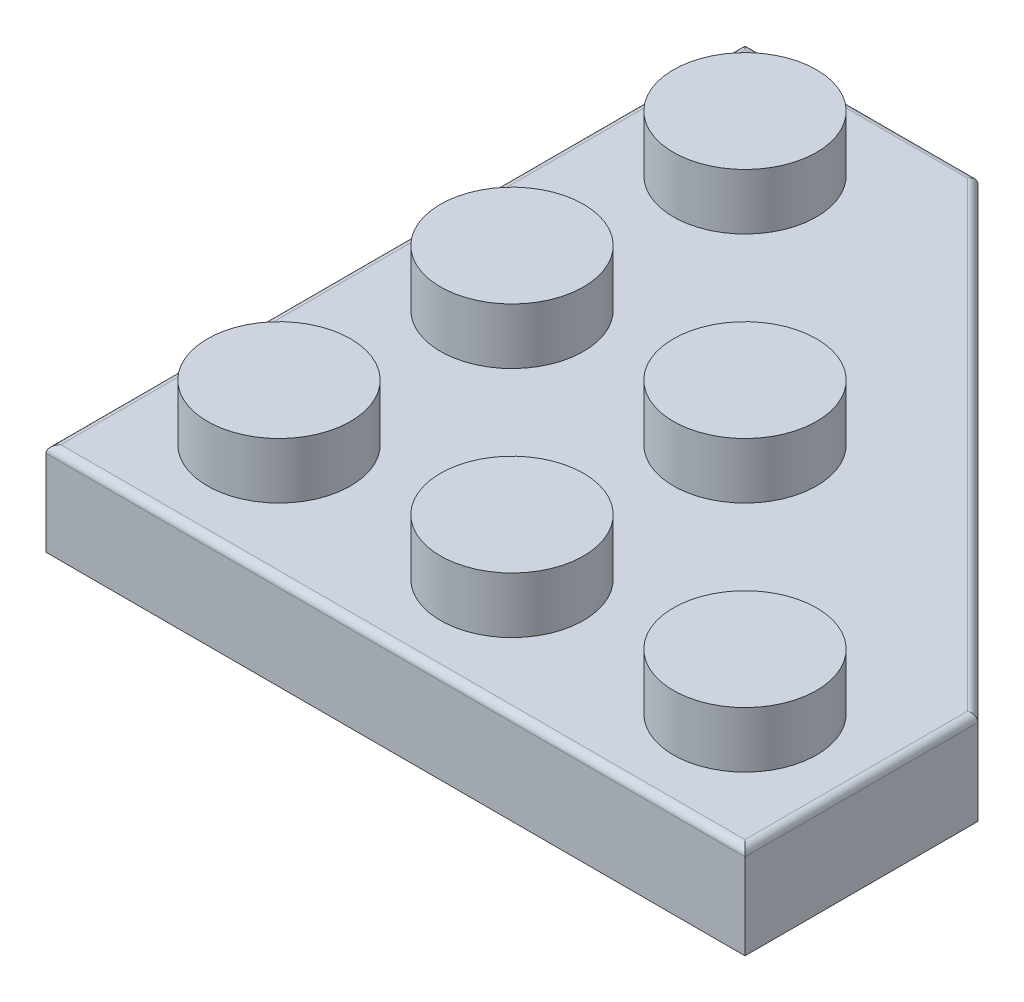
ISO-10303-21;
HEADER;
FILE_DESCRIPTION(('STEP AP214'),'2;1');
FILE_NAME('part.step','',(''),(''),'','','');
FILE_SCHEMA(('AUTOMOTIVE_DESIGN { 1 0 10303 214 1 1 1 1 }'));
ENDSEC;
DATA;
#1=APPLICATION_CONTEXT('core data for automotive mechanical design processes');
#2=APPLICATION_PROTOCOL_DEFINITION('international standard','automotive_design',2000,#1);
#3=PRODUCT_CONTEXT('',#1,'mechanical');
#4=PRODUCT('Part','Part','',(#3));
#5=PRODUCT_RELATED_PRODUCT_CATEGORY('part','',(#4));
#6=PRODUCT_DEFINITION_FORMATION('','',#4);
#7=PRODUCT_DEFINITION_CONTEXT('part definition',#1,'design');
#8=PRODUCT_DEFINITION('design','',#6,#7);
#9=PRODUCT_DEFINITION_SHAPE('','',#8);
#10=(LENGTH_UNIT() NAMED_UNIT(*) SI_UNIT(.MILLI.,.METRE.));
#11=(NAMED_UNIT(*) PLANE_ANGLE_UNIT() SI_UNIT($,.RADIAN.));
#12=(NAMED_UNIT(*) SI_UNIT($,.STERADIAN.) SOLID_ANGLE_UNIT());
#13=UNCERTAINTY_MEASURE_WITH_UNIT(LENGTH_MEASURE(1.E-05),#10,'distance_accuracy_value','');
#14=(GEOMETRIC_REPRESENTATION_CONTEXT(3) GLOBAL_UNCERTAINTY_ASSIGNED_CONTEXT((#13)) GLOBAL_UNIT_ASSIGNED_CONTEXT((#10,
#11,#12)) REPRESENTATION_CONTEXT('',''));
#15=CARTESIAN_POINT('',(0.,0.,0.));
#16=DIRECTION('',(0.,0.,1.));
#17=DIRECTION('',(1.,0.,0.));
#18=AXIS2_PLACEMENT_3D('',#15,#16,#17);
#19=CARTESIAN_POINT('',(10.7837179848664,0.,5.09128201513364));
#20=DIRECTION('',(0.707106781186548,0.,-0.707106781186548));
#21=DIRECTION('',(-0.707106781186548,0.,-0.707106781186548));
#22=AXIS2_PLACEMENT_3D('',#19,#20,#21);
#23=PLANE('',#22);
#24=DIRECTION('',(0.,1.,0.));
#25=VECTOR('',#24,1.);
#26=CARTESIAN_POINT('',(2.49266459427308,5.081,-3.19977137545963));
#27=LINE('',#26,#25);
#28=CARTESIAN_POINT('',(2.49266459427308,0.,-3.19977137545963));
#29=VERTEX_POINT('',#28);
#30=CARTESIAN_POINT('',(2.49266459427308,1.5875,-3.19977137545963));
#31=VERTEX_POINT('',#30);
#32=EDGE_CURVE('E202',#29,#31,#27,.T.);
#33=ORIENTED_EDGE('',*,*,#32,.T.);
#34=DIRECTION('',(-0.707106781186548,0.,-0.707106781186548));
#35=VECTOR('',#34,1.);
#36=CARTESIAN_POINT('',(10.7837179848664,1.5875,5.09128201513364));
#37=LINE('',#36,#35);
#38=CARTESIAN_POINT('',(0.152141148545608,1.5875,-5.5402948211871));
#39=VERTEX_POINT('',#38);
#40=EDGE_CURVE('E317',#31,#39,#37,.T.);
#41=ORIENTED_EDGE('',*,*,#40,.T.);
#42=DIRECTION('',(0.,-1.,0.));
#43=VECTOR('',#42,1.);
#44=CARTESIAN_POINT('',(0.15214114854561,8.001,-5.5402948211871));
#45=LINE('',#44,#43);
#46=CARTESIAN_POINT('',(0.15214114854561,0.,-5.5402948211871));
#47=VERTEX_POINT('',#46);
#48=EDGE_CURVE('E227',#39,#47,#45,.T.);
#49=ORIENTED_EDGE('',*,*,#48,.T.);
#50=DIRECTION('',(-0.707106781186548,0.,-0.707106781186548));
#51=VECTOR('',#50,1.);
#52=CARTESIAN_POINT('',(10.7837179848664,0.,5.09128201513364));
#53=LINE('',#52,#51);
#54=EDGE_CURVE('E219',#29,#47,#53,.T.);
#55=ORIENTED_EDGE('',*,*,#54,.F.);
#56=EDGE_LOOP('',(#33,#41,#49,#55));
#57=FACE_BOUND('',#56,.T.);
#58=ADVANCED_FACE('F38',(#57),#23,.F.);
#59=CARTESIAN_POINT('',(-11.90625,0.,11.90625));
#60=DIRECTION('',(0.,-1.,0.));
#61=DIRECTION('',(0.,0.,-1.));
#62=AXIS2_PLACEMENT_3D('',#59,#60,#61);
#63=PLANE('',#62);
#64=CARTESIAN_POINT('',(5.5402948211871,0.,-0.15214114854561));
#65=VERTEX_POINT('',#64);
#66=CARTESIAN_POINT('',(3.19977137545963,0.,-2.49266459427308));
#67=VERTEX_POINT('',#66);
#68=EDGE_CURVE('E228',#65,#67,#53,.T.);
#69=ORIENTED_EDGE('',*,*,#68,.T.);
#70=DIRECTION('',(-0.707106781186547,0.,0.707106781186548));
#71=VECTOR('',#70,1.);
#72=CARTESIAN_POINT('',(3.24168091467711,0.,-2.53457413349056));
#73=LINE('',#72,#71);
#74=CARTESIAN_POINT('',(2.34365530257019,0.,-1.63654852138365));
#75=VERTEX_POINT('',#74);
#76=EDGE_CURVE('E516',#67,#75,#73,.T.);
#77=ORIENTED_EDGE('',*,*,#76,.T.);
#78=DIRECTION('',(-0.707106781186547,0.,-0.707106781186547));
#79=VECTOR('',#78,1.);
#80=CARTESIAN_POINT('',(2.34365530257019,0.,-1.63654852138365));
#81=LINE('',#80,#79);
#82=CARTESIAN_POINT('',(1.63654852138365,0.,-2.3436553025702));
#83=VERTEX_POINT('',#82);
#84=EDGE_CURVE('E223',#75,#83,#81,.T.);
#85=ORIENTED_EDGE('',*,*,#84,.T.);
#86=DIRECTION('',(-0.707106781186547,0.,0.707106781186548));
#87=VECTOR('',#86,1.);
#88=CARTESIAN_POINT('',(2.53457413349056,0.,-3.24168091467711));
#89=LINE('',#88,#87);
#90=EDGE_CURVE('E205',#29,#83,#89,.T.);
#91=ORIENTED_EDGE('',*,*,#90,.F.);
#92=ORIENTED_EDGE('',*,*,#54,.T.);
#93=DIRECTION('',(0.707106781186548,0.,-0.707106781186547));
#94=VECTOR('',#93,1.);
#95=CARTESIAN_POINT('',(0.15214114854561,0.,-5.5402948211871));
#96=LINE('',#95,#94);
#97=CARTESIAN_POINT('',(1.27467316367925,0.,-6.66282683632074));
#98=VERTEX_POINT('',#97);
#99=EDGE_CURVE('E533',#47,#98,#96,.T.);
#100=ORIENTED_EDGE('',*,*,#99,.T.);
#101=DIRECTION('',(-0.707106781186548,0.,-0.707106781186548));
#102=VECTOR('',#101,1.);
#103=CARTESIAN_POINT('',(11.90625,0.,3.96875));
#104=LINE('',#103,#102);
#105=CARTESIAN_POINT('',(6.66282683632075,0.,-1.27467316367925));
#106=VERTEX_POINT('',#105);
#107=EDGE_CURVE('E1342',#106,#98,#104,.T.);
#108=ORIENTED_EDGE('',*,*,#107,.F.);
#109=DIRECTION('',(0.707106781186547,0.,-0.707106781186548));
#110=VECTOR('',#109,1.);
#111=CARTESIAN_POINT('',(5.5402948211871,0.,-0.15214114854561));
#112=LINE('',#111,#110);
#113=EDGE_CURVE('E530',#65,#106,#112,.T.);
#114=ORIENTED_EDGE('',*,*,#113,.F.);
#115=EDGE_LOOP('',(#69,#77,#85,#91,#92,#100,#108,#114));
#116=FACE_BOUND('',#115,.T.);
#117=ADVANCED_FACE('F217',(#116),#63,.T.);
#118=CARTESIAN_POINT('',(-2.13782416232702,0.,-10.075324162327));
#119=VERTEX_POINT('',#118);
#120=CARTESIAN_POINT('',(-3.96875,0.,-11.90625));
#121=VERTEX_POINT('',#120);
#122=EDGE_CURVE('E277',#119,#121,#104,.T.);
#123=ORIENTED_EDGE('',*,*,#122,.F.);
#124=DIRECTION('',(-0.707106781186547,0.,0.707106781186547));
#125=VECTOR('',#124,1.);
#126=CARTESIAN_POINT('',(-2.13782416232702,0.,-10.075324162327));
#127=LINE('',#126,#125);
#128=CARTESIAN_POINT('',(-3.26035617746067,0.,-8.95279214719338));
#129=VERTEX_POINT('',#128);
#130=EDGE_CURVE('E524',#119,#129,#127,.T.);
#131=ORIENTED_EDGE('',*,*,#130,.T.);
#132=CARTESIAN_POINT('',(-4.62631403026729,0.,-10.31875));
#133=VERTEX_POINT('',#132);
#134=EDGE_CURVE('E229',#129,#133,#53,.T.);
#135=ORIENTED_EDGE('',*,*,#134,.T.);
#136=DIRECTION('',(1.,0.,0.));
#137=VECTOR('',#136,1.);
#138=CARTESIAN_POINT('',(-11.90625,0.,-10.31875));
#139=LINE('',#138,#137);
#140=CARTESIAN_POINT('',(-10.31875,0.,-10.31875));
#141=VERTEX_POINT('',#140);
#142=EDGE_CURVE('E280',#141,#133,#139,.T.);
#143=ORIENTED_EDGE('',*,*,#142,.F.);
#144=DIRECTION('',(0.,0.,1.));
#145=VECTOR('',#144,1.);
#146=CARTESIAN_POINT('',(-10.31875,0.,11.90625));
#147=LINE('',#146,#145);
#148=CARTESIAN_POINT('',(-10.31875,0.,10.31875));
#149=VERTEX_POINT('',#148);
#150=EDGE_CURVE('E259',#141,#149,#147,.T.);
#151=ORIENTED_EDGE('',*,*,#150,.T.);
#152=DIRECTION('',(-1.,0.,0.));
#153=VECTOR('',#152,1.);
#154=CARTESIAN_POINT('',(-11.90625,0.,10.31875));
#155=LINE('',#154,#153);
#156=CARTESIAN_POINT('',(10.31875,0.,10.31875));
#157=VERTEX_POINT('',#156);
#158=EDGE_CURVE('E281',#157,#149,#155,.T.);
#159=ORIENTED_EDGE('',*,*,#158,.F.);
#160=DIRECTION('',(0.,0.,-1.));
#161=VECTOR('',#160,1.);
#162=CARTESIAN_POINT('',(10.31875,0.,11.90625));
#163=LINE('',#162,#161);
#164=CARTESIAN_POINT('',(10.31875,0.,4.62631403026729));
#165=VERTEX_POINT('',#164);
#166=EDGE_CURVE('E278',#157,#165,#163,.T.);
#167=ORIENTED_EDGE('',*,*,#166,.T.);
#168=CARTESIAN_POINT('',(8.95279214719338,0.,3.26035617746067));
#169=VERTEX_POINT('',#168);
#170=EDGE_CURVE('E231',#165,#169,#53,.T.);
#171=ORIENTED_EDGE('',*,*,#170,.T.);
#172=DIRECTION('',(-0.707106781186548,0.,0.707106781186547));
#173=VECTOR('',#172,1.);
#174=CARTESIAN_POINT('',(10.075324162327,0.,2.13782416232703));
#175=LINE('',#174,#173);
#176=CARTESIAN_POINT('',(10.075324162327,0.,2.13782416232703));
#177=VERTEX_POINT('',#176);
#178=EDGE_CURVE('E553',#177,#169,#175,.T.);
#179=ORIENTED_EDGE('',*,*,#178,.F.);
#180=CARTESIAN_POINT('',(11.90625,0.,3.96875));
#181=VERTEX_POINT('',#180);
#182=EDGE_CURVE('E684',#181,#177,#104,.T.);
#183=ORIENTED_EDGE('',*,*,#182,.F.);
#184=DIRECTION('',(0.,0.,-1.));
#185=VECTOR('',#184,1.);
#186=CARTESIAN_POINT('',(11.90625,0.,11.90625));
#187=LINE('',#186,#185);
#188=CARTESIAN_POINT('',(11.90625,0.,11.90625));
#189=VERTEX_POINT('',#188);
#190=EDGE_CURVE('E678',#189,#181,#187,.T.);
#191=ORIENTED_EDGE('',*,*,#190,.F.);
#192=DIRECTION('',(-1.,0.,0.));
#193=VECTOR('',#192,1.);
#194=CARTESIAN_POINT('',(11.90625,0.,11.90625));
#195=LINE('',#194,#193);
#196=CARTESIAN_POINT('',(-11.90625,0.,11.90625));
#197=VERTEX_POINT('',#196);
#198=EDGE_CURVE('E693',#189,#197,#195,.T.);
#199=ORIENTED_EDGE('',*,*,#198,.T.);
#200=DIRECTION('',(0.,0.,1.));
#201=VECTOR('',#200,1.);
#202=CARTESIAN_POINT('',(-11.90625,0.,-11.90625));
#203=LINE('',#202,#201);
#204=CARTESIAN_POINT('',(-11.90625,0.,-11.90625));
#205=VERTEX_POINT('',#204);
#206=EDGE_CURVE('E489',#205,#197,#203,.T.);
#207=ORIENTED_EDGE('',*,*,#206,.F.);
#208=DIRECTION('',(1.,0.,0.));
#209=VECTOR('',#208,1.);
#210=CARTESIAN_POINT('',(-11.90625,0.,-11.90625));
#211=LINE('',#210,#209);
#212=EDGE_CURVE('E696',#205,#121,#211,.T.);
#213=ORIENTED_EDGE('',*,*,#212,.T.);
#214=EDGE_LOOP('',(#123,#131,#135,#143,#151,#159,#167,#171,#179,#183,#191,#199,#207,#213));
#215=FACE_BOUND('',#214,.T.);
#216=ADVANCED_FACE('F381',(#215),#63,.T.);
#217=CARTESIAN_POINT('',(11.90625,0.,3.96875));
#218=DIRECTION('',(0.707106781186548,0.,-0.707106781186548));
#219=DIRECTION('',(-0.707106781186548,0.,-0.707106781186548));
#220=AXIS2_PLACEMENT_3D('',#217,#218,#219);
#221=PLANE('',#220);
#222=DIRECTION('',(0.,1.,0.));
#223=VECTOR('',#222,1.);
#224=CARTESIAN_POINT('',(-3.96875,0.,-11.90625));
#225=LINE('',#224,#223);
#226=CARTESIAN_POINT('',(-3.96875,2.921,-11.90625));
#227=VERTEX_POINT('',#226);
#228=EDGE_CURVE('E674',#121,#227,#225,.T.);
#229=ORIENTED_EDGE('',*,*,#228,.T.);
#230=DIRECTION('',(-0.707106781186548,0.,-0.707106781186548));
#231=VECTOR('',#230,1.);
#232=CARTESIAN_POINT('',(11.90625,2.921,3.96875));
#233=LINE('',#232,#231);
#234=CARTESIAN_POINT('',(11.90625,2.921,3.96875));
#235=VERTEX_POINT('',#234);
#236=EDGE_CURVE('E11',#227,#235,#233,.F.);
#237=ORIENTED_EDGE('',*,*,#236,.T.);
#238=DIRECTION('',(0.,1.,0.));
#239=VECTOR('',#238,1.);
#240=CARTESIAN_POINT('',(11.90625,0.,3.96875));
#241=LINE('',#240,#239);
#242=EDGE_CURVE('E672',#181,#235,#241,.T.);
#243=ORIENTED_EDGE('',*,*,#242,.F.);
#244=ORIENTED_EDGE('',*,*,#182,.T.);
#245=DIRECTION('',(0.,-1.,0.));
#246=VECTOR('',#245,1.);
#247=CARTESIAN_POINT('',(10.075324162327,8.001,2.13782416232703));
#248=LINE('',#247,#246);
#249=CARTESIAN_POINT('',(10.075324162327,1.5875,2.13782416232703));
#250=VERTEX_POINT('',#249);
#251=EDGE_CURVE('E557',#250,#177,#248,.T.);
#252=ORIENTED_EDGE('',*,*,#251,.F.);
#253=DIRECTION('',(-0.707106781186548,0.,-0.707106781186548));
#254=VECTOR('',#253,1.);
#255=CARTESIAN_POINT('',(6.66282683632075,1.5875,-1.27467316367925));
#256=LINE('',#255,#254);
#257=CARTESIAN_POINT('',(6.66282683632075,1.5875,-1.27467316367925));
#258=VERTEX_POINT('',#257);
#259=EDGE_CURVE('E545',#250,#258,#256,.T.);
#260=ORIENTED_EDGE('',*,*,#259,.T.);
#261=DIRECTION('',(0.,-1.,0.));
#262=VECTOR('',#261,1.);
#263=CARTESIAN_POINT('',(6.66282683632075,8.001,-1.27467316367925));
#264=LINE('',#263,#262);
#265=EDGE_CURVE('E559',#258,#106,#264,.T.);
#266=ORIENTED_EDGE('',*,*,#265,.T.);
#267=ORIENTED_EDGE('',*,*,#107,.T.);
#268=DIRECTION('',(0.,-1.,0.));
#269=VECTOR('',#268,1.);
#270=CARTESIAN_POINT('',(1.27467316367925,8.001,-6.66282683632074));
#271=LINE('',#270,#269);
#272=CARTESIAN_POINT('',(1.27467316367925,1.5875,-6.66282683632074));
#273=VERTEX_POINT('',#272);
#274=EDGE_CURVE('E538',#273,#98,#271,.T.);
#275=ORIENTED_EDGE('',*,*,#274,.F.);
#276=DIRECTION('',(0.707106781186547,0.,0.707106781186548));
#277=VECTOR('',#276,1.);
#278=CARTESIAN_POINT('',(1.27467316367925,1.5875,-6.66282683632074));
#279=LINE('',#278,#277);
#280=CARTESIAN_POINT('',(-2.13782416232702,1.5875,-10.075324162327));
#281=VERTEX_POINT('',#280);
#282=EDGE_CURVE('E528',#281,#273,#279,.T.);
#283=ORIENTED_EDGE('',*,*,#282,.F.);
#284=DIRECTION('',(0.,-1.,0.));
#285=VECTOR('',#284,1.);
#286=CARTESIAN_POINT('',(-2.13782416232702,8.001,-10.075324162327));
#287=LINE('',#286,#285);
#288=EDGE_CURVE('E535',#281,#119,#287,.T.);
#289=ORIENTED_EDGE('',*,*,#288,.T.);
#290=ORIENTED_EDGE('',*,*,#122,.T.);
#291=EDGE_LOOP('',(#229,#237,#243,#244,#252,#260,#266,#267,#275,#283,#289,#290));
#292=FACE_BOUND('',#291,.T.);
#293=ADVANCED_FACE('F388',(#292),#221,.T.);
#294=CARTESIAN_POINT('',(5.5402948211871,1.5875,-0.15214114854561));
#295=VERTEX_POINT('',#294);
#296=CARTESIAN_POINT('',(3.19977137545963,1.5875,-2.49266459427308));
#297=VERTEX_POINT('',#296);
#298=EDGE_CURVE('E316',#295,#297,#37,.T.);
#299=ORIENTED_EDGE('',*,*,#298,.T.);
#300=DIRECTION('',(0.,1.,0.));
#301=VECTOR('',#300,1.);
#302=CARTESIAN_POINT('',(3.19977137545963,5.081,-2.49266459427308));
#303=LINE('',#302,#301);
#304=EDGE_CURVE('E213',#67,#297,#303,.T.);
#305=ORIENTED_EDGE('',*,*,#304,.F.);
#306=ORIENTED_EDGE('',*,*,#68,.F.);
#307=DIRECTION('',(0.,-1.,0.));
#308=VECTOR('',#307,1.);
#309=CARTESIAN_POINT('',(5.5402948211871,8.001,-0.15214114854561));
#310=LINE('',#309,#308);
#311=EDGE_CURVE('E555',#295,#65,#310,.T.);
#312=ORIENTED_EDGE('',*,*,#311,.F.);
#313=EDGE_LOOP('',(#299,#305,#306,#312));
#314=FACE_BOUND('',#313,.T.);
#315=ADVANCED_FACE('F377',(#314),#23,.F.);
#316=DIRECTION('',(0.,-1.,0.));
#317=VECTOR('',#316,1.);
#318=CARTESIAN_POINT('',(-3.26035617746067,8.001,-8.95279214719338));
#319=LINE('',#318,#317);
#320=CARTESIAN_POINT('',(-3.26035617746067,1.5875,-8.95279214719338));
#321=VERTEX_POINT('',#320);
#322=EDGE_CURVE('E541',#321,#129,#319,.T.);
#323=ORIENTED_EDGE('',*,*,#322,.F.);
#324=CARTESIAN_POINT('',(-4.62631403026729,1.5875,-10.31875));
#325=VERTEX_POINT('',#324);
#326=EDGE_CURVE('E321',#321,#325,#37,.T.);
#327=ORIENTED_EDGE('',*,*,#326,.T.);
#328=DIRECTION('',(0.,1.,0.));
#329=VECTOR('',#328,1.);
#330=CARTESIAN_POINT('',(-4.62631403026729,0.,-10.31875));
#331=LINE('',#330,#329);
#332=EDGE_CURVE('E236',#133,#325,#331,.T.);
#333=ORIENTED_EDGE('',*,*,#332,.F.);
#334=ORIENTED_EDGE('',*,*,#134,.F.);
#335=EDGE_LOOP('',(#323,#327,#333,#334));
#336=FACE_BOUND('',#335,.T.);
#337=ADVANCED_FACE('F376',(#336),#23,.F.);
#338=CARTESIAN_POINT('',(10.31875,1.5875,4.62631403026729));
#339=VERTEX_POINT('',#338);
#340=CARTESIAN_POINT('',(8.95279214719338,1.5875,3.26035617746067));
#341=VERTEX_POINT('',#340);
#342=EDGE_CURVE('E232',#339,#341,#37,.T.);
#343=ORIENTED_EDGE('',*,*,#342,.T.);
#344=DIRECTION('',(0.,-1.,0.));
#345=VECTOR('',#344,1.);
#346=CARTESIAN_POINT('',(8.95279214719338,8.001,3.26035617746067));
#347=LINE('',#346,#345);
#348=EDGE_CURVE('E549',#341,#169,#347,.T.);
#349=ORIENTED_EDGE('',*,*,#348,.T.);
#350=ORIENTED_EDGE('',*,*,#170,.F.);
#351=DIRECTION('',(0.,1.,0.));
#352=VECTOR('',#351,1.);
#353=CARTESIAN_POINT('',(10.31875,0.,4.62631403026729));
#354=LINE('',#353,#352);
#355=EDGE_CURVE('E242',#165,#339,#354,.T.);
#356=ORIENTED_EDGE('',*,*,#355,.T.);
#357=EDGE_LOOP('',(#343,#349,#350,#356));
#358=FACE_BOUND('',#357,.T.);
#359=ADVANCED_FACE('F386',(#358),#23,.F.);
#360=CARTESIAN_POINT('',(-11.90625,1.5875,11.90625));
#361=DIRECTION('',(0.,-1.,0.));
#362=DIRECTION('',(0.,0.,-1.));
#363=AXIS2_PLACEMENT_3D('',#360,#361,#362);
#364=PLANE('',#363);
#365=DIRECTION('',(0.707106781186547,0.,-0.707106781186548));
#366=VECTOR('',#365,1.);
#367=CARTESIAN_POINT('',(3.24168091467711,1.5875,-2.53457413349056));
#368=LINE('',#367,#366);
#369=CARTESIAN_POINT('',(2.34365530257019,1.5875,-1.63654852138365));
#370=VERTEX_POINT('',#369);
#371=EDGE_CURVE('E522',#370,#297,#368,.T.);
#372=ORIENTED_EDGE('',*,*,#371,.T.);
#373=ORIENTED_EDGE('',*,*,#298,.F.);
#374=DIRECTION('',(-0.707106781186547,0.,0.707106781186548));
#375=VECTOR('',#374,1.);
#376=CARTESIAN_POINT('',(5.5402948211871,1.5875,-0.15214114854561));
#377=LINE('',#376,#375);
#378=EDGE_CURVE('E551',#258,#295,#377,.T.);
#379=ORIENTED_EDGE('',*,*,#378,.F.);
#380=ORIENTED_EDGE('',*,*,#259,.F.);
#381=DIRECTION('',(0.707106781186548,0.,-0.707106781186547));
#382=VECTOR('',#381,1.);
#383=CARTESIAN_POINT('',(10.075324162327,1.5875,2.13782416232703));
#384=LINE('',#383,#382);
#385=EDGE_CURVE('E548',#341,#250,#384,.T.);
#386=ORIENTED_EDGE('',*,*,#385,.F.);
#387=ORIENTED_EDGE('',*,*,#342,.F.);
#388=DIRECTION('',(0.,0.,-1.));
#389=VECTOR('',#388,1.);
#390=CARTESIAN_POINT('',(10.31875,1.5875,11.90625));
#391=LINE('',#390,#389);
#392=CARTESIAN_POINT('',(10.31875,1.5875,10.31875));
#393=VERTEX_POINT('',#392);
#394=EDGE_CURVE('E293',#393,#339,#391,.T.);
#395=ORIENTED_EDGE('',*,*,#394,.F.);
#396=DIRECTION('',(-1.,0.,0.));
#397=VECTOR('',#396,1.);
#398=CARTESIAN_POINT('',(-11.90625,1.5875,10.31875));
#399=LINE('',#398,#397);
#400=CARTESIAN_POINT('',(-10.31875,1.5875,10.31875));
#401=VERTEX_POINT('',#400);
#402=EDGE_CURVE('E286',#393,#401,#399,.T.);
#403=ORIENTED_EDGE('',*,*,#402,.T.);
#404=DIRECTION('',(0.,0.,1.));
#405=VECTOR('',#404,1.);
#406=CARTESIAN_POINT('',(-10.31875,1.5875,11.90625));
#407=LINE('',#406,#405);
#408=CARTESIAN_POINT('',(-10.31875,1.5875,-10.31875));
#409=VERTEX_POINT('',#408);
#410=EDGE_CURVE('E284',#409,#401,#407,.T.);
#411=ORIENTED_EDGE('',*,*,#410,.F.);
#412=DIRECTION('',(1.,0.,0.));
#413=VECTOR('',#412,1.);
#414=CARTESIAN_POINT('',(-11.90625,1.5875,-10.31875));
#415=LINE('',#414,#413);
#416=EDGE_CURVE('E296',#409,#325,#415,.T.);
#417=ORIENTED_EDGE('',*,*,#416,.T.);
#418=ORIENTED_EDGE('',*,*,#326,.F.);
#419=DIRECTION('',(0.707106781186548,0.,-0.707106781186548));
#420=VECTOR('',#419,1.);
#421=CARTESIAN_POINT('',(-2.13782416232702,1.5875,-10.075324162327));
#422=LINE('',#421,#420);
#423=EDGE_CURVE('E527',#321,#281,#422,.T.);
#424=ORIENTED_EDGE('',*,*,#423,.T.);
#425=ORIENTED_EDGE('',*,*,#282,.T.);
#426=DIRECTION('',(-0.707106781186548,0.,0.707106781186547));
#427=VECTOR('',#426,1.);
#428=CARTESIAN_POINT('',(0.15214114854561,1.5875,-5.5402948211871));
#429=LINE('',#428,#427);
#430=EDGE_CURVE('E525',#273,#39,#429,.T.);
#431=ORIENTED_EDGE('',*,*,#430,.T.);
#432=ORIENTED_EDGE('',*,*,#40,.F.);
#433=DIRECTION('',(0.707106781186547,0.,-0.707106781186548));
#434=VECTOR('',#433,1.);
#435=CARTESIAN_POINT('',(2.53457413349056,1.5875,-3.24168091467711));
#436=LINE('',#435,#434);
#437=CARTESIAN_POINT('',(1.63654852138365,1.5875,-2.34365530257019));
#438=VERTEX_POINT('',#437);
#439=EDGE_CURVE('E208',#438,#31,#436,.T.);
#440=ORIENTED_EDGE('',*,*,#439,.F.);
#441=DIRECTION('',(0.707106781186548,0.,0.707106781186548));
#442=VECTOR('',#441,1.);
#443=CARTESIAN_POINT('',(2.34365530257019,1.5875,-1.63654852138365));
#444=LINE('',#443,#442);
#445=EDGE_CURVE('E212',#438,#370,#444,.T.);
#446=ORIENTED_EDGE('',*,*,#445,.T.);
#447=EDGE_LOOP('',(#372,#373,#379,#380,#386,#387,#395,#403,#411,#417,#418,#424,#425,#431,#432,
#440,#446));
#448=FACE_BOUND('',#447,.T.);
#449=CARTESIAN_POINT('',(-7.9375,1.5875,-7.9375));
#450=DIRECTION('',(0.,-1.,0.));
#451=DIRECTION('',(0.,0.,-1.));
#452=AXIS2_PLACEMENT_3D('',#449,#450,#451);
#453=CIRCLE('',#452,0.8509);
#454=CARTESIAN_POINT('',(-7.9375,1.5875,-8.7884));
#455=VERTEX_POINT('',#454);
#456=EDGE_CURVE('E273',#455,#455,#453,.F.);
#457=ORIENTED_EDGE('',*,*,#456,.T.);
#458=EDGE_LOOP('',(#457));
#459=FACE_BOUND('',#458,.T.);
#460=CARTESIAN_POINT('',(-7.9375,1.5875,0.));
#461=DIRECTION('',(0.,-1.,0.));
#462=DIRECTION('',(0.,0.,-1.));
#463=AXIS2_PLACEMENT_3D('',#460,#461,#462);
#464=CIRCLE('',#463,0.8509);
#465=CARTESIAN_POINT('',(-7.9375,1.5875,-0.8509));
#466=VERTEX_POINT('',#465);
#467=EDGE_CURVE('E268',#466,#466,#464,.F.);
#468=ORIENTED_EDGE('',*,*,#467,.T.);
#469=EDGE_LOOP('',(#468));
#470=FACE_BOUND('',#469,.T.);
#471=CARTESIAN_POINT('',(7.9375,1.5875,7.9375));
#472=DIRECTION('',(0.,-1.,0.));
#473=DIRECTION('',(0.,0.,-1.));
#474=AXIS2_PLACEMENT_3D('',#471,#472,#473);
#475=CIRCLE('',#474,0.8509);
#476=CARTESIAN_POINT('',(7.9375,1.5875,7.0866));
#477=VERTEX_POINT('',#476);
#478=EDGE_CURVE('E269',#477,#477,#475,.F.);
#479=ORIENTED_EDGE('',*,*,#478,.T.);
#480=EDGE_LOOP('',(#479));
#481=FACE_BOUND('',#480,.T.);
#482=CARTESIAN_POINT('',(0.,1.5875,7.9375));
#483=DIRECTION('',(0.,-1.,0.));
#484=DIRECTION('',(0.,0.,-1.));
#485=AXIS2_PLACEMENT_3D('',#482,#483,#484);
#486=CIRCLE('',#485,0.8509);
#487=CARTESIAN_POINT('',(0.,1.5875,7.0866));
#488=VERTEX_POINT('',#487);
#489=EDGE_CURVE('E311',#488,#488,#486,.F.);
#490=ORIENTED_EDGE('',*,*,#489,.T.);
#491=EDGE_LOOP('',(#490));
#492=FACE_BOUND('',#491,.T.);
#493=CARTESIAN_POINT('',(-7.9375,1.5875,7.9375));
#494=DIRECTION('',(0.,-1.,0.));
#495=DIRECTION('',(0.,0.,-1.));
#496=AXIS2_PLACEMENT_3D('',#493,#494,#495);
#497=CIRCLE('',#496,0.8509);
#498=CARTESIAN_POINT('',(-7.9375,1.5875,7.0866));
#499=VERTEX_POINT('',#498);
#500=EDGE_CURVE('E303',#499,#499,#497,.F.);
#501=ORIENTED_EDGE('',*,*,#500,.T.);
#502=EDGE_LOOP('',(#501));
#503=FACE_BOUND('',#502,.T.);
#504=CARTESIAN_POINT('',(0.,1.5875,0.));
#505=DIRECTION('',(0.,-1.,0.));
#506=DIRECTION('',(0.,0.,-1.));
#507=AXIS2_PLACEMENT_3D('',#504,#505,#506);
#508=CIRCLE('',#507,0.8509);
#509=CARTESIAN_POINT('',(0.,1.5875,-0.8509));
#510=VERTEX_POINT('',#509);
#511=EDGE_CURVE('E306',#510,#510,#508,.F.);
#512=ORIENTED_EDGE('',*,*,#511,.T.);
#513=EDGE_LOOP('',(#512));
#514=FACE_BOUND('',#513,.T.);
#515=CARTESIAN_POINT('',(-3.96875,1.5875,-3.96875));
#516=DIRECTION('',(0.,-1.,0.));
#517=DIRECTION('',(1.,0.,0.));
#518=AXIS2_PLACEMENT_3D('',#515,#516,#517);
#519=CIRCLE('',#518,3.2004);
#520=CARTESIAN_POINT('',(-0.76835,1.5875,-3.96875));
#521=VERTEX_POINT('',#520);
#522=EDGE_CURVE('E328',#521,#521,#519,.T.);
#523=ORIENTED_EDGE('',*,*,#522,.F.);
#524=EDGE_LOOP('',(#523));
#525=FACE_BOUND('',#524,.T.);
#526=CARTESIAN_POINT('',(-3.96875,1.58750000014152,3.96875));
#527=DIRECTION('',(0.,-1.,0.));
#528=DIRECTION('',(1.,0.,0.));
#529=AXIS2_PLACEMENT_3D('',#526,#527,#528);
#530=CIRCLE('',#529,3.2004);
#531=CARTESIAN_POINT('',(-0.76835,1.58750000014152,3.96875));
#532=VERTEX_POINT('',#531);
#533=EDGE_CURVE('E574',#532,#532,#530,.T.);
#534=ORIENTED_EDGE('',*,*,#533,.F.);
#535=EDGE_LOOP('',(#534));
#536=FACE_BOUND('',#535,.T.);
#537=CARTESIAN_POINT('',(3.96875,1.58750000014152,3.96875));
#538=DIRECTION('',(0.,-1.,0.));
#539=DIRECTION('',(1.,0.,0.));
#540=AXIS2_PLACEMENT_3D('',#537,#538,#539);
#541=CIRCLE('',#540,3.2004);
#542=CARTESIAN_POINT('',(7.16915,1.58750000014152,3.96875));
#543=VERTEX_POINT('',#542);
#544=EDGE_CURVE('E568',#543,#543,#541,.T.);
#545=ORIENTED_EDGE('',*,*,#544,.F.);
#546=EDGE_LOOP('',(#545));
#547=FACE_BOUND('',#546,.T.);
#548=ADVANCED_FACE('F351',(#448,#459,#470,#481,#492,#503,#514,#525,#536,#547),#364,.T.);
#549=CARTESIAN_POINT('',(-11.90625,3.175,11.90625));
#550=DIRECTION('',(0.,-1.,0.));
#551=DIRECTION('',(0.,0.,-1.));
#552=AXIS2_PLACEMENT_3D('',#549,#550,#551);
#553=PLANE('',#552);
#554=DIRECTION('',(-1.,0.,0.));
#555=VECTOR('',#554,1.);
#556=CARTESIAN_POINT('',(11.90625,3.175,11.65225));
#557=LINE('',#556,#555);
#558=CARTESIAN_POINT('',(-11.65225,3.175,11.65225));
#559=VERTEX_POINT('',#558);
#560=CARTESIAN_POINT('',(11.65225,3.175,11.65225));
#561=VERTEX_POINT('',#560);
#562=EDGE_CURVE('E466',#559,#561,#557,.F.);
#563=ORIENTED_EDGE('',*,*,#562,.T.);
#564=DIRECTION('',(0.,0.,-1.));
#565=VECTOR('',#564,1.);
#566=CARTESIAN_POINT('',(11.65225,3.175,11.90625));
#567=LINE('',#566,#565);
#568=CARTESIAN_POINT('',(11.65225,3.175,4.07396024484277));
#569=VERTEX_POINT('',#568);
#570=EDGE_CURVE('E468',#561,#569,#567,.T.);
#571=ORIENTED_EDGE('',*,*,#570,.T.);
#572=DIRECTION('',(-0.707106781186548,0.,-0.707106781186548));
#573=VECTOR('',#572,1.);
#574=CARTESIAN_POINT('',(-4.14835512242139,3.175,-11.7266448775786));
#575=LINE('',#574,#573);
#576=CARTESIAN_POINT('',(-4.07396024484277,3.175,-11.65225));
#577=VERTEX_POINT('',#576);
#578=EDGE_CURVE('E454',#569,#577,#575,.T.);
#579=ORIENTED_EDGE('',*,*,#578,.T.);
#580=DIRECTION('',(1.,0.,0.));
#581=VECTOR('',#580,1.);
#582=CARTESIAN_POINT('',(-11.90625,3.175,-11.65225));
#583=LINE('',#582,#581);
#584=CARTESIAN_POINT('',(-11.65225,3.175,-11.65225));
#585=VERTEX_POINT('',#584);
#586=EDGE_CURVE('E462',#577,#585,#583,.F.);
#587=ORIENTED_EDGE('',*,*,#586,.T.);
#588=DIRECTION('',(0.,0.,1.));
#589=VECTOR('',#588,1.);
#590=CARTESIAN_POINT('',(-11.65225,3.175,11.90625));
#591=LINE('',#590,#589);
#592=EDGE_CURVE('E464',#585,#559,#591,.T.);
#593=ORIENTED_EDGE('',*,*,#592,.T.);
#594=EDGE_LOOP('',(#563,#571,#579,#587,#593));
#595=FACE_BOUND('',#594,.T.);
#596=CARTESIAN_POINT('',(-7.9375,3.175,-7.9375));
#597=DIRECTION('',(0.,-1.,0.));
#598=DIRECTION('',(0.,0.,-1.));
#599=AXIS2_PLACEMENT_3D('',#596,#597,#598);
#600=CIRCLE('',#599,2.4384);
#601=CARTESIAN_POINT('',(-7.9375,3.175,-10.3759));
#602=VERTEX_POINT('',#601);
#603=EDGE_CURVE('E722',#602,#602,#600,.F.);
#604=ORIENTED_EDGE('',*,*,#603,.F.);
#605=EDGE_LOOP('',(#604));
#606=FACE_BOUND('',#605,.T.);
#607=CARTESIAN_POINT('',(-7.9375,3.175,0.));
#608=DIRECTION('',(0.,-1.,0.));
#609=DIRECTION('',(0.,0.,-1.));
#610=AXIS2_PLACEMENT_3D('',#607,#608,#609);
#611=CIRCLE('',#610,2.4384);
#612=CARTESIAN_POINT('',(-7.9375,3.175,-2.4384));
#613=VERTEX_POINT('',#612);
#614=EDGE_CURVE('E716',#613,#613,#611,.F.);
#615=ORIENTED_EDGE('',*,*,#614,.F.);
#616=EDGE_LOOP('',(#615));
#617=FACE_BOUND('',#616,.T.);
#618=CARTESIAN_POINT('',(7.9375,3.175,7.9375));
#619=DIRECTION('',(0.,-1.,0.));
#620=DIRECTION('',(0.,0.,-1.));
#621=AXIS2_PLACEMENT_3D('',#618,#619,#620);
#622=CIRCLE('',#621,2.4384);
#623=CARTESIAN_POINT('',(7.9375,3.175,5.4991));
#624=VERTEX_POINT('',#623);
#625=EDGE_CURVE('E710',#624,#624,#622,.F.);
#626=ORIENTED_EDGE('',*,*,#625,.F.);
#627=EDGE_LOOP('',(#626));
#628=FACE_BOUND('',#627,.T.);
#629=CARTESIAN_POINT('',(0.,3.175,7.9375));
#630=DIRECTION('',(0.,-1.,0.));
#631=DIRECTION('',(0.,0.,-1.));
#632=AXIS2_PLACEMENT_3D('',#629,#630,#631);
#633=CIRCLE('',#632,2.4384);
#634=CARTESIAN_POINT('',(0.,3.175,5.4991));
#635=VERTEX_POINT('',#634);
#636=EDGE_CURVE('E707',#635,#635,#633,.F.);
#637=ORIENTED_EDGE('',*,*,#636,.F.);
#638=EDGE_LOOP('',(#637));
#639=FACE_BOUND('',#638,.T.);
#640=CARTESIAN_POINT('',(-7.9375,3.175,7.9375));
#641=DIRECTION('',(0.,-1.,0.));
#642=DIRECTION('',(0.,0.,-1.));
#643=AXIS2_PLACEMENT_3D('',#640,#641,#642);
#644=CIRCLE('',#643,2.4384);
#645=CARTESIAN_POINT('',(-7.9375,3.175,5.4991));
#646=VERTEX_POINT('',#645);
#647=EDGE_CURVE('E491',#646,#646,#644,.F.);
#648=ORIENTED_EDGE('',*,*,#647,.F.);
#649=EDGE_LOOP('',(#648));
#650=FACE_BOUND('',#649,.T.);
#651=CARTESIAN_POINT('',(0.,3.175,0.));
#652=DIRECTION('',(0.,-1.,0.));
#653=DIRECTION('',(0.,0.,-1.));
#654=AXIS2_PLACEMENT_3D('',#651,#652,#653);
#655=CIRCLE('',#654,2.4384);
#656=CARTESIAN_POINT('',(0.,3.175,-2.4384));
#657=VERTEX_POINT('',#656);
#658=EDGE_CURVE('E704',#657,#657,#655,.F.);
#659=ORIENTED_EDGE('',*,*,#658,.F.);
#660=EDGE_LOOP('',(#659));
#661=FACE_BOUND('',#660,.T.);
#662=ADVANCED_FACE('F398',(#595,#606,#617,#628,#639,#650,#661),#553,.F.);
#663=CARTESIAN_POINT('',(11.90625,3.175,11.90625));
#664=DIRECTION('',(-1.,0.,0.));
#665=DIRECTION('',(0.,0.,1.));
#666=AXIS2_PLACEMENT_3D('',#663,#664,#665);
#667=PLANE('',#666);
#668=ORIENTED_EDGE('',*,*,#242,.T.);
#669=DIRECTION('',(0.,0.,-1.));
#670=VECTOR('',#669,1.);
#671=CARTESIAN_POINT('',(11.90625,2.921,11.90625));
#672=LINE('',#671,#670);
#673=CARTESIAN_POINT('',(11.90625,2.921,11.90625));
#674=VERTEX_POINT('',#673);
#675=EDGE_CURVE('E471',#235,#674,#672,.F.);
#676=ORIENTED_EDGE('',*,*,#675,.T.);
#677=DIRECTION('',(0.,-1.,0.));
#678=VECTOR('',#677,1.);
#679=CARTESIAN_POINT('',(11.90625,3.175,11.90625));
#680=LINE('',#679,#678);
#681=EDGE_CURVE('E483',#674,#189,#680,.T.);
#682=ORIENTED_EDGE('',*,*,#681,.T.);
#683=ORIENTED_EDGE('',*,*,#190,.T.);
#684=EDGE_LOOP('',(#668,#676,#682,#683));
#685=FACE_BOUND('',#684,.T.);
#686=ADVANCED_FACE('F406',(#685),#667,.F.);
#687=CARTESIAN_POINT('',(-11.90625,3.175,-11.90625));
#688=DIRECTION('',(0.,0.,-1.));
#689=DIRECTION('',(-1.,0.,0.));
#690=AXIS2_PLACEMENT_3D('',#687,#688,#689);
#691=PLANE('',#690);
#692=DIRECTION('',(0.,-1.,0.));
#693=VECTOR('',#692,1.);
#694=CARTESIAN_POINT('',(-11.90625,3.175,-11.90625));
#695=LINE('',#694,#693);
#696=CARTESIAN_POINT('',(-11.90625,2.921,-11.90625));
#697=VERTEX_POINT('',#696);
#698=EDGE_CURVE('E699',#697,#205,#695,.T.);
#699=ORIENTED_EDGE('',*,*,#698,.F.);
#700=DIRECTION('',(1.,0.,0.));
#701=VECTOR('',#700,1.);
#702=CARTESIAN_POINT('',(-3.96875,2.921,-11.90625));
#703=LINE('',#702,#701);
#704=EDGE_CURVE('E46',#697,#227,#703,.T.);
#705=ORIENTED_EDGE('',*,*,#704,.T.);
#706=ORIENTED_EDGE('',*,*,#228,.F.);
#707=ORIENTED_EDGE('',*,*,#212,.F.);
#708=EDGE_LOOP('',(#699,#705,#706,#707));
#709=FACE_BOUND('',#708,.T.);
#710=ADVANCED_FACE('F1215',(#709),#691,.T.);
#711=CARTESIAN_POINT('',(-11.90625,3.175,-11.90625));
#712=DIRECTION('',(1.,0.,0.));
#713=DIRECTION('',(0.,0.,-1.));
#714=AXIS2_PLACEMENT_3D('',#711,#712,#713);
#715=PLANE('',#714);
#716=DIRECTION('',(0.,-1.,0.));
#717=VECTOR('',#716,1.);
#718=CARTESIAN_POINT('',(-11.90625,3.175,11.90625));
#719=LINE('',#718,#717);
#720=CARTESIAN_POINT('',(-11.90625,2.921,11.90625));
#721=VERTEX_POINT('',#720);
#722=EDGE_CURVE('E481',#721,#197,#719,.T.);
#723=ORIENTED_EDGE('',*,*,#722,.F.);
#724=DIRECTION('',(0.,0.,1.));
#725=VECTOR('',#724,1.);
#726=CARTESIAN_POINT('',(-11.90625,2.921,-11.90625));
#727=LINE('',#726,#725);
#728=EDGE_CURVE('E60',#721,#697,#727,.F.);
#729=ORIENTED_EDGE('',*,*,#728,.T.);
#730=ORIENTED_EDGE('',*,*,#698,.T.);
#731=ORIENTED_EDGE('',*,*,#206,.T.);
#732=EDGE_LOOP('',(#723,#729,#730,#731));
#733=FACE_BOUND('',#732,.T.);
#734=ADVANCED_FACE('F487',(#733),#715,.F.);
#735=CARTESIAN_POINT('',(11.90625,3.175,11.90625));
#736=DIRECTION('',(0.,0.,1.));
#737=DIRECTION('',(1.,0.,0.));
#738=AXIS2_PLACEMENT_3D('',#735,#736,#737);
#739=PLANE('',#738);
#740=ORIENTED_EDGE('',*,*,#681,.F.);
#741=DIRECTION('',(-1.,0.,0.));
#742=VECTOR('',#741,1.);
#743=CARTESIAN_POINT('',(-11.90625,2.921,11.90625));
#744=LINE('',#743,#742);
#745=EDGE_CURVE('E474',#674,#721,#744,.T.);
#746=ORIENTED_EDGE('',*,*,#745,.T.);
#747=ORIENTED_EDGE('',*,*,#722,.T.);
#748=ORIENTED_EDGE('',*,*,#198,.F.);
#749=EDGE_LOOP('',(#740,#746,#747,#748));
#750=FACE_BOUND('',#749,.T.);
#751=ADVANCED_FACE('F479',(#750),#739,.T.);
#752=CARTESIAN_POINT('',(-7.9375,5.08,7.9375));
#753=DIRECTION('',(0.,-1.,0.));
#754=DIRECTION('',(0.,0.,-1.));
#755=AXIS2_PLACEMENT_3D('',#752,#753,#754);
#756=CYLINDRICAL_SURFACE('',#755,2.4384);
#757=CARTESIAN_POINT('',(-7.9375,5.08,7.9375));
#758=DIRECTION('',(0.,1.,0.));
#759=DIRECTION('',(0.,0.,1.));
#760=AXIS2_PLACEMENT_3D('',#757,#758,#759);
#761=CIRCLE('',#760,2.4384);
#762=CARTESIAN_POINT('',(-7.9375,5.08,5.4991));
#763=VERTEX_POINT('',#762);
#764=EDGE_CURVE('E689',#763,#763,#761,.T.);
#765=CARTESIAN_POINT('',(-7.9375,5.08,5.4991));
#766=CARTESIAN_POINT('',(-7.9375,5.06015625,5.4991));
#767=CARTESIAN_POINT('',(-7.9375,5.0403125,5.4991));
#768=CARTESIAN_POINT('',(-7.9375,5.000625,5.4991));
#769=CARTESIAN_POINT('',(-7.9375,4.98078125,5.4991));
#770=CARTESIAN_POINT('',(-7.9375,4.94109375,5.4991));
#771=CARTESIAN_POINT('',(-7.9375,4.92125,5.4991));
#772=CARTESIAN_POINT('',(-7.9375,4.8815625,5.4991));
#773=CARTESIAN_POINT('',(-7.9375,4.86171875,5.4991));
#774=CARTESIAN_POINT('',(-7.9375,4.82203125,5.4991));
#775=CARTESIAN_POINT('',(-7.9375,4.8021875,5.4991));
#776=CARTESIAN_POINT('',(-7.9375,4.7625,5.4991));
#777=CARTESIAN_POINT('',(-7.9375,4.74265625,5.4991));
#778=CARTESIAN_POINT('',(-7.9375,4.70296875,5.4991));
#779=CARTESIAN_POINT('',(-7.9375,4.683125,5.4991));
#780=CARTESIAN_POINT('',(-7.9375,4.6434375,5.4991));
#781=CARTESIAN_POINT('',(-7.9375,4.62359375,5.4991));
#782=CARTESIAN_POINT('',(-7.9375,4.58390625,5.4991));
#783=CARTESIAN_POINT('',(-7.9375,4.5640625,5.4991));
#784=CARTESIAN_POINT('',(-7.9375,4.524375,5.4991));
#785=CARTESIAN_POINT('',(-7.9375,4.50453125,5.4991));
#786=CARTESIAN_POINT('',(-7.9375,4.46484375,5.4991));
#787=CARTESIAN_POINT('',(-7.9375,4.445,5.4991));
#788=CARTESIAN_POINT('',(-7.9375,4.4053125,5.4991));
#789=CARTESIAN_POINT('',(-7.9375,4.38546875,5.4991));
#790=CARTESIAN_POINT('',(-7.9375,4.34578125,5.4991));
#791=CARTESIAN_POINT('',(-7.9375,4.3259375,5.4991));
#792=CARTESIAN_POINT('',(-7.9375,4.28625,5.4991));
#793=CARTESIAN_POINT('',(-7.9375,4.26640625,5.4991));
#794=CARTESIAN_POINT('',(-7.9375,4.22671875,5.4991));
#795=CARTESIAN_POINT('',(-7.9375,4.206875,5.4991));
#796=CARTESIAN_POINT('',(-7.9375,4.1671875,5.4991));
#797=CARTESIAN_POINT('',(-7.9375,4.14734375,5.4991));
#798=CARTESIAN_POINT('',(-7.9375,4.10765625,5.4991));
#799=CARTESIAN_POINT('',(-7.9375,4.0878125,5.4991));
#800=CARTESIAN_POINT('',(-7.9375,4.048125,5.4991));
#801=CARTESIAN_POINT('',(-7.9375,4.02828125,5.4991));
#802=CARTESIAN_POINT('',(-7.9375,3.98859375,5.4991));
#803=CARTESIAN_POINT('',(-7.9375,3.96875,5.4991));
#804=CARTESIAN_POINT('',(-7.9375,3.9290625,5.4991));
#805=CARTESIAN_POINT('',(-7.9375,3.90921875,5.4991));
#806=CARTESIAN_POINT('',(-7.9375,3.86953125,5.4991));
#807=CARTESIAN_POINT('',(-7.9375,3.8496875,5.4991));
#808=CARTESIAN_POINT('',(-7.9375,3.81,5.4991));
#809=CARTESIAN_POINT('',(-7.9375,3.79015625,5.4991));
#810=CARTESIAN_POINT('',(-7.9375,3.75046875,5.4991));
#811=CARTESIAN_POINT('',(-7.9375,3.730625,5.4991));
#812=CARTESIAN_POINT('',(-7.9375,3.6909375,5.4991));
#813=CARTESIAN_POINT('',(-7.9375,3.67109375,5.4991));
#814=CARTESIAN_POINT('',(-7.9375,3.63140625,5.4991));
#815=CARTESIAN_POINT('',(-7.9375,3.6115625,5.4991));
#816=CARTESIAN_POINT('',(-7.9375,3.571875,5.4991));
#817=CARTESIAN_POINT('',(-7.9375,3.55203125,5.4991));
#818=CARTESIAN_POINT('',(-7.9375,3.51234375,5.4991));
#819=CARTESIAN_POINT('',(-7.9375,3.4925,5.4991));
#820=CARTESIAN_POINT('',(-7.9375,3.4528125,5.4991));
#821=CARTESIAN_POINT('',(-7.9375,3.43296875,5.4991));
#822=CARTESIAN_POINT('',(-7.9375,3.39328125,5.4991));
#823=CARTESIAN_POINT('',(-7.9375,3.3734375,5.4991));
#824=CARTESIAN_POINT('',(-7.9375,3.33375,5.4991));
#825=CARTESIAN_POINT('',(-7.9375,3.31390625,5.4991));
#826=CARTESIAN_POINT('',(-7.9375,3.27421875,5.4991));
#827=CARTESIAN_POINT('',(-7.9375,3.254375,5.4991));
#828=CARTESIAN_POINT('',(-7.9375,3.2146875,5.4991));
#829=CARTESIAN_POINT('',(-7.9375,3.19484375,5.4991));
#830=CARTESIAN_POINT('',(-7.9375,3.175,5.4991));
#831=B_SPLINE_CURVE_WITH_KNOTS('',3,(#765,#766,#767,#768,#769,#770,#771,#772,#773,#774,#775,
#776,#777,#778,#779,#780,#781,#782,#783,#784,#785,#786,#787,#788,#789,#790,#791,#792,#793,#794,
#795,#796,#797,#798,#799,#800,#801,#802,#803,#804,#805,#806,#807,#808,#809,#810,#811,#812,#813,
#814,#815,#816,#817,#818,#819,#820,#821,#822,#823,#824,#825,#826,#827,#828,#829,#830),
.UNSPECIFIED.,.F.,.F.,(4,2,2,2,2,2,2,2,2,2,2,2,2,2,2,2,2,2,2,2,2,2,2,2,2,2,2,2,2,2,2,2,4),(0.,
0.0595312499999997,0.119062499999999,0.178593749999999,0.238125,0.297656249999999,
0.357187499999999,0.41671875,0.476249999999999,0.535781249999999,0.595312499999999,
0.654843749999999,0.714374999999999,0.773906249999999,0.833437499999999,0.892968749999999,
0.952499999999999,1.01203125,1.0715625,1.13109375,1.190625,1.25015625,1.3096875,1.36921875,
1.42875,1.48828125,1.5478125,1.60734375,1.666875,1.72640625,1.7859375,1.84546875,1.905),.UNSPECIFIED.);
#832=EDGE_CURVE('BSEAM758',#763,#646,#831,.T.);
#833=ORIENTED_EDGE('',*,*,#764,.F.);
#834=ORIENTED_EDGE('',*,*,#647,.T.);
#835=ORIENTED_EDGE('',*,*,#832,.T.);
#836=ORIENTED_EDGE('',*,*,#832,.F.);
#837=EDGE_LOOP('',(#833,#835,#834,#836));
#838=FACE_BOUND('',#837,.T.);
#839=ADVANCED_FACE('F758',(#838),#756,.T.);
#840=CARTESIAN_POINT('',(-7.9375,5.08,7.9375));
#841=DIRECTION('',(0.,1.,0.));
#842=DIRECTION('',(0.,0.,1.));
#843=AXIS2_PLACEMENT_3D('',#840,#841,#842);
#844=PLANE('',#843);
#845=ORIENTED_EDGE('',*,*,#764,.T.);
#846=EDGE_LOOP('',(#845));
#847=FACE_BOUND('',#846,.T.);
#848=ADVANCED_FACE('F747',(#847),#844,.T.);
#849=CARTESIAN_POINT('',(0.,5.08,0.));
#850=DIRECTION('',(0.,-1.,0.));
#851=DIRECTION('',(0.,0.,-1.));
#852=AXIS2_PLACEMENT_3D('',#849,#850,#851);
#853=CYLINDRICAL_SURFACE('',#852,2.4384);
#854=CARTESIAN_POINT('',(0.,5.08,0.));
#855=DIRECTION('',(0.,1.,0.));
#856=DIRECTION('',(0.,0.,1.));
#857=AXIS2_PLACEMENT_3D('',#854,#855,#856);
#858=CIRCLE('',#857,2.4384);
#859=CARTESIAN_POINT('',(0.,5.08,-2.4384));
#860=VERTEX_POINT('',#859);
#861=EDGE_CURVE('E682',#860,#860,#858,.T.);
#862=CARTESIAN_POINT('',(0.,5.08,-2.4384));
#863=CARTESIAN_POINT('',(0.,5.06015625,-2.4384));
#864=CARTESIAN_POINT('',(0.,5.0403125,-2.4384));
#865=CARTESIAN_POINT('',(0.,5.000625,-2.4384));
#866=CARTESIAN_POINT('',(0.,4.98078125,-2.4384));
#867=CARTESIAN_POINT('',(0.,4.94109375,-2.4384));
#868=CARTESIAN_POINT('',(0.,4.92125,-2.4384));
#869=CARTESIAN_POINT('',(0.,4.8815625,-2.4384));
#870=CARTESIAN_POINT('',(0.,4.86171875,-2.4384));
#871=CARTESIAN_POINT('',(0.,4.82203125,-2.4384));
#872=CARTESIAN_POINT('',(0.,4.8021875,-2.4384));
#873=CARTESIAN_POINT('',(0.,4.7625,-2.4384));
#874=CARTESIAN_POINT('',(0.,4.74265625,-2.4384));
#875=CARTESIAN_POINT('',(0.,4.70296875,-2.4384));
#876=CARTESIAN_POINT('',(0.,4.683125,-2.4384));
#877=CARTESIAN_POINT('',(0.,4.6434375,-2.4384));
#878=CARTESIAN_POINT('',(0.,4.62359375,-2.4384));
#879=CARTESIAN_POINT('',(0.,4.58390625,-2.4384));
#880=CARTESIAN_POINT('',(0.,4.5640625,-2.4384));
#881=CARTESIAN_POINT('',(0.,4.524375,-2.4384));
#882=CARTESIAN_POINT('',(0.,4.50453125,-2.4384));
#883=CARTESIAN_POINT('',(0.,4.46484375,-2.4384));
#884=CARTESIAN_POINT('',(0.,4.445,-2.4384));
#885=CARTESIAN_POINT('',(0.,4.4053125,-2.4384));
#886=CARTESIAN_POINT('',(0.,4.38546875,-2.4384));
#887=CARTESIAN_POINT('',(0.,4.34578125,-2.4384));
#888=CARTESIAN_POINT('',(0.,4.3259375,-2.4384));
#889=CARTESIAN_POINT('',(0.,4.28625,-2.4384));
#890=CARTESIAN_POINT('',(0.,4.26640625,-2.4384));
#891=CARTESIAN_POINT('',(0.,4.22671875,-2.4384));
#892=CARTESIAN_POINT('',(0.,4.206875,-2.4384));
#893=CARTESIAN_POINT('',(0.,4.1671875,-2.4384));
#894=CARTESIAN_POINT('',(0.,4.14734375,-2.4384));
#895=CARTESIAN_POINT('',(0.,4.10765625,-2.4384));
#896=CARTESIAN_POINT('',(0.,4.0878125,-2.4384));
#897=CARTESIAN_POINT('',(0.,4.048125,-2.4384));
#898=CARTESIAN_POINT('',(0.,4.02828125,-2.4384));
#899=CARTESIAN_POINT('',(0.,3.98859375,-2.4384));
#900=CARTESIAN_POINT('',(0.,3.96875,-2.4384));
#901=CARTESIAN_POINT('',(0.,3.9290625,-2.4384));
#902=CARTESIAN_POINT('',(0.,3.90921875,-2.4384));
#903=CARTESIAN_POINT('',(0.,3.86953125,-2.4384));
#904=CARTESIAN_POINT('',(0.,3.8496875,-2.4384));
#905=CARTESIAN_POINT('',(0.,3.81,-2.4384));
#906=CARTESIAN_POINT('',(0.,3.79015625,-2.4384));
#907=CARTESIAN_POINT('',(0.,3.75046875,-2.4384));
#908=CARTESIAN_POINT('',(0.,3.730625,-2.4384));
#909=CARTESIAN_POINT('',(0.,3.6909375,-2.4384));
#910=CARTESIAN_POINT('',(0.,3.67109375,-2.4384));
#911=CARTESIAN_POINT('',(0.,3.63140625,-2.4384));
#912=CARTESIAN_POINT('',(0.,3.6115625,-2.4384));
#913=CARTESIAN_POINT('',(0.,3.571875,-2.4384));
#914=CARTESIAN_POINT('',(0.,3.55203125,-2.4384));
#915=CARTESIAN_POINT('',(0.,3.51234375,-2.4384));
#916=CARTESIAN_POINT('',(0.,3.4925,-2.4384));
#917=CARTESIAN_POINT('',(0.,3.4528125,-2.4384));
#918=CARTESIAN_POINT('',(0.,3.43296875,-2.4384));
#919=CARTESIAN_POINT('',(0.,3.39328125,-2.4384));
#920=CARTESIAN_POINT('',(0.,3.3734375,-2.4384));
#921=CARTESIAN_POINT('',(0.,3.33375,-2.4384));
#922=CARTESIAN_POINT('',(0.,3.31390625,-2.4384));
#923=CARTESIAN_POINT('',(0.,3.27421875,-2.4384));
#924=CARTESIAN_POINT('',(0.,3.254375,-2.4384));
#925=CARTESIAN_POINT('',(0.,3.2146875,-2.4384));
#926=CARTESIAN_POINT('',(0.,3.19484375,-2.4384));
#927=CARTESIAN_POINT('',(0.,3.175,-2.4384));
#928=B_SPLINE_CURVE_WITH_KNOTS('',3,(#862,#863,#864,#865,#866,#867,#868,#869,#870,#871,#872,
#873,#874,#875,#876,#877,#878,#879,#880,#881,#882,#883,#884,#885,#886,#887,#888,#889,#890,#891,
#892,#893,#894,#895,#896,#897,#898,#899,#900,#901,#902,#903,#904,#905,#906,#907,#908,#909,#910,
#911,#912,#913,#914,#915,#916,#917,#918,#919,#920,#921,#922,#923,#924,#925,#926,#927),
.UNSPECIFIED.,.F.,.F.,(4,2,2,2,2,2,2,2,2,2,2,2,2,2,2,2,2,2,2,2,2,2,2,2,2,2,2,2,2,2,2,2,4),(0.,
0.0595312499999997,0.119062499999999,0.178593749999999,0.238125,0.297656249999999,
0.357187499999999,0.41671875,0.476249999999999,0.535781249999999,0.595312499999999,
0.654843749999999,0.714374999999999,0.773906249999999,0.833437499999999,0.892968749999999,
0.952499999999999,1.01203125,1.0715625,1.13109375,1.190625,1.25015625,1.3096875,1.36921875,
1.42875,1.48828125,1.5478125,1.60734375,1.666875,1.72640625,1.7859375,1.84546875,1.905),.UNSPECIFIED.);
#929=EDGE_CURVE('BSEAM744',#860,#657,#928,.T.);
#930=ORIENTED_EDGE('',*,*,#861,.F.);
#931=ORIENTED_EDGE('',*,*,#658,.T.);
#932=ORIENTED_EDGE('',*,*,#929,.T.);
#933=ORIENTED_EDGE('',*,*,#929,.F.);
#934=EDGE_LOOP('',(#930,#932,#931,#933));
#935=FACE_BOUND('',#934,.T.);
#936=ADVANCED_FACE('F744',(#935),#853,.T.);
#937=CARTESIAN_POINT('',(0.,5.08,0.));
#938=DIRECTION('',(0.,1.,0.));
#939=DIRECTION('',(0.,0.,1.));
#940=AXIS2_PLACEMENT_3D('',#937,#938,#939);
#941=PLANE('',#940);
#942=ORIENTED_EDGE('',*,*,#861,.T.);
#943=EDGE_LOOP('',(#942));
#944=FACE_BOUND('',#943,.T.);
#945=ADVANCED_FACE('F746',(#944),#941,.T.);
#946=CARTESIAN_POINT('',(0.,5.08,7.9375));
#947=DIRECTION('',(0.,-1.,0.));
#948=DIRECTION('',(0.,0.,-1.));
#949=AXIS2_PLACEMENT_3D('',#946,#947,#948);
#950=CYLINDRICAL_SURFACE('',#949,2.4384);
#951=CARTESIAN_POINT('',(0.,5.08,7.9375));
#952=DIRECTION('',(0.,1.,0.));
#953=DIRECTION('',(0.,0.,1.));
#954=AXIS2_PLACEMENT_3D('',#951,#952,#953);
#955=CIRCLE('',#954,2.4384);
#956=CARTESIAN_POINT('',(0.,5.08,5.4991));
#957=VERTEX_POINT('',#956);
#958=EDGE_CURVE('E679',#957,#957,#955,.T.);
#959=CARTESIAN_POINT('',(0.,5.08,5.4991));
#960=CARTESIAN_POINT('',(0.,5.06015625,5.4991));
#961=CARTESIAN_POINT('',(0.,5.0403125,5.4991));
#962=CARTESIAN_POINT('',(0.,5.000625,5.4991));
#963=CARTESIAN_POINT('',(0.,4.98078125,5.4991));
#964=CARTESIAN_POINT('',(0.,4.94109375,5.4991));
#965=CARTESIAN_POINT('',(0.,4.92125,5.4991));
#966=CARTESIAN_POINT('',(0.,4.8815625,5.4991));
#967=CARTESIAN_POINT('',(0.,4.86171875,5.4991));
#968=CARTESIAN_POINT('',(0.,4.82203125,5.4991));
#969=CARTESIAN_POINT('',(0.,4.8021875,5.4991));
#970=CARTESIAN_POINT('',(0.,4.7625,5.4991));
#971=CARTESIAN_POINT('',(0.,4.74265625,5.4991));
#972=CARTESIAN_POINT('',(0.,4.70296875,5.4991));
#973=CARTESIAN_POINT('',(0.,4.683125,5.4991));
#974=CARTESIAN_POINT('',(0.,4.6434375,5.4991));
#975=CARTESIAN_POINT('',(0.,4.62359375,5.4991));
#976=CARTESIAN_POINT('',(0.,4.58390625,5.4991));
#977=CARTESIAN_POINT('',(0.,4.5640625,5.4991));
#978=CARTESIAN_POINT('',(0.,4.524375,5.4991));
#979=CARTESIAN_POINT('',(0.,4.50453125,5.4991));
#980=CARTESIAN_POINT('',(0.,4.46484375,5.4991));
#981=CARTESIAN_POINT('',(0.,4.445,5.4991));
#982=CARTESIAN_POINT('',(0.,4.4053125,5.4991));
#983=CARTESIAN_POINT('',(0.,4.38546875,5.4991));
#984=CARTESIAN_POINT('',(0.,4.34578125,5.4991));
#985=CARTESIAN_POINT('',(0.,4.3259375,5.4991));
#986=CARTESIAN_POINT('',(0.,4.28625,5.4991));
#987=CARTESIAN_POINT('',(0.,4.26640625,5.4991));
#988=CARTESIAN_POINT('',(0.,4.22671875,5.4991));
#989=CARTESIAN_POINT('',(0.,4.206875,5.4991));
#990=CARTESIAN_POINT('',(0.,4.1671875,5.4991));
#991=CARTESIAN_POINT('',(0.,4.14734375,5.4991));
#992=CARTESIAN_POINT('',(0.,4.10765625,5.4991));
#993=CARTESIAN_POINT('',(0.,4.0878125,5.4991));
#994=CARTESIAN_POINT('',(0.,4.048125,5.4991));
#995=CARTESIAN_POINT('',(0.,4.02828125,5.4991));
#996=CARTESIAN_POINT('',(0.,3.98859375,5.4991));
#997=CARTESIAN_POINT('',(0.,3.96875,5.4991));
#998=CARTESIAN_POINT('',(0.,3.9290625,5.4991));
#999=CARTESIAN_POINT('',(0.,3.90921875,5.4991));
#1000=CARTESIAN_POINT('',(0.,3.86953125,5.4991));
#1001=CARTESIAN_POINT('',(0.,3.8496875,5.4991));
#1002=CARTESIAN_POINT('',(0.,3.81,5.4991));
#1003=CARTESIAN_POINT('',(0.,3.79015625,5.4991));
#1004=CARTESIAN_POINT('',(0.,3.75046875,5.4991));
#1005=CARTESIAN_POINT('',(0.,3.730625,5.4991));
#1006=CARTESIAN_POINT('',(0.,3.6909375,5.4991));
#1007=CARTESIAN_POINT('',(0.,3.67109375,5.4991));
#1008=CARTESIAN_POINT('',(0.,3.63140625,5.4991));
#1009=CARTESIAN_POINT('',(0.,3.6115625,5.4991));
#1010=CARTESIAN_POINT('',(0.,3.571875,5.4991));
#1011=CARTESIAN_POINT('',(0.,3.55203125,5.4991));
#1012=CARTESIAN_POINT('',(0.,3.51234375,5.4991));
#1013=CARTESIAN_POINT('',(0.,3.4925,5.4991));
#1014=CARTESIAN_POINT('',(0.,3.4528125,5.4991));
#1015=CARTESIAN_POINT('',(0.,3.43296875,5.4991));
#1016=CARTESIAN_POINT('',(0.,3.39328125,5.4991));
#1017=CARTESIAN_POINT('',(0.,3.3734375,5.4991));
#1018=CARTESIAN_POINT('',(0.,3.33375,5.4991));
#1019=CARTESIAN_POINT('',(0.,3.31390625,5.4991));
#1020=CARTESIAN_POINT('',(0.,3.27421875,5.4991));
#1021=CARTESIAN_POINT('',(0.,3.254375,5.4991));
#1022=CARTESIAN_POINT('',(0.,3.2146875,5.4991));
#1023=CARTESIAN_POINT('',(0.,3.19484375,5.4991));
#1024=CARTESIAN_POINT('',(0.,3.175,5.4991));
#1025=B_SPLINE_CURVE_WITH_KNOTS('',3,(#959,#960,#961,#962,#963,#964,#965,#966,#967,#968,#969,
#970,#971,#972,#973,#974,#975,#976,#977,#978,#979,#980,#981,#982,#983,#984,#985,#986,#987,#988,
#989,#990,#991,#992,#993,#994,#995,#996,#997,#998,#999,#1000,#1001,#1002,#1003,#1004,#1005,
#1006,#1007,#1008,#1009,#1010,#1011,#1012,#1013,#1014,#1015,#1016,#1017,#1018,#1019,#1020,#1021,
#1022,#1023,#1024),.UNSPECIFIED.,.F.,.F.,(4,2,2,2,2,2,2,2,2,2,2,2,2,2,2,2,2,2,2,2,2,2,2,2,2,2,2,
2,2,2,2,2,4),(0.,0.0595312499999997,0.119062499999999,0.178593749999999,0.238125,
0.297656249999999,0.357187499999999,0.41671875,0.476249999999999,0.535781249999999,
0.595312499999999,0.654843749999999,0.714374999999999,0.773906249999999,0.833437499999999,
0.892968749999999,0.952499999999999,1.01203125,1.0715625,1.13109375,1.190625,1.25015625,
1.3096875,1.36921875,1.42875,1.48828125,1.5478125,1.60734375,1.666875,1.72640625,1.7859375,
1.84546875,1.905),.UNSPECIFIED.);
#1026=EDGE_CURVE('BSEAM755',#957,#635,#1025,.T.);
#1027=ORIENTED_EDGE('',*,*,#958,.F.);
#1028=ORIENTED_EDGE('',*,*,#636,.T.);
#1029=ORIENTED_EDGE('',*,*,#1026,.T.);
#1030=ORIENTED_EDGE('',*,*,#1026,.F.);
#1031=EDGE_LOOP('',(#1027,#1029,#1028,#1030));
#1032=FACE_BOUND('',#1031,.T.);
#1033=ADVANCED_FACE('F755',(#1032),#950,.T.);
#1034=CARTESIAN_POINT('',(0.,5.08,7.9375));
#1035=DIRECTION('',(0.,1.,0.));
#1036=DIRECTION('',(0.,0.,1.));
#1037=AXIS2_PLACEMENT_3D('',#1034,#1035,#1036);
#1038=PLANE('',#1037);
#1039=ORIENTED_EDGE('',*,*,#958,.T.);
#1040=EDGE_LOOP('',(#1039));
#1041=FACE_BOUND('',#1040,.T.);
#1042=ADVANCED_FACE('F750',(#1041),#1038,.T.);
#1043=CARTESIAN_POINT('',(7.9375,5.08,7.9375));
#1044=DIRECTION('',(0.,1.,0.));
#1045=DIRECTION('',(0.,0.,1.));
#1046=AXIS2_PLACEMENT_3D('',#1043,#1044,#1045);
#1047=PLANE('',#1046);
#1048=CARTESIAN_POINT('',(7.9375,5.08,7.9375));
#1049=DIRECTION('',(0.,1.,0.));
#1050=DIRECTION('',(0.,0.,1.));
#1051=AXIS2_PLACEMENT_3D('',#1048,#1049,#1050);
#1052=CIRCLE('',#1051,2.4384);
#1053=CARTESIAN_POINT('',(7.9375,5.08,5.4991));
#1054=VERTEX_POINT('',#1053);
#1055=EDGE_CURVE('E713',#1054,#1054,#1052,.T.);
#1056=ORIENTED_EDGE('',*,*,#1055,.T.);
#1057=EDGE_LOOP('',(#1056));
#1058=FACE_BOUND('',#1057,.T.);
#1059=ADVANCED_FACE('F763',(#1058),#1047,.T.);
#1060=CARTESIAN_POINT('',(7.9375,5.08,7.9375));
#1061=DIRECTION('',(0.,-1.,0.));
#1062=DIRECTION('',(0.,0.,-1.));
#1063=AXIS2_PLACEMENT_3D('',#1060,#1061,#1062);
#1064=CYLINDRICAL_SURFACE('',#1063,2.4384);
#1065=CARTESIAN_POINT('',(7.9375,5.08,5.4991));
#1066=CARTESIAN_POINT('',(7.9375,5.06015625,5.4991));
#1067=CARTESIAN_POINT('',(7.9375,5.0403125,5.4991));
#1068=CARTESIAN_POINT('',(7.9375,5.000625,5.4991));
#1069=CARTESIAN_POINT('',(7.9375,4.98078125,5.4991));
#1070=CARTESIAN_POINT('',(7.9375,4.94109375,5.4991));
#1071=CARTESIAN_POINT('',(7.9375,4.92125,5.4991));
#1072=CARTESIAN_POINT('',(7.9375,4.8815625,5.4991));
#1073=CARTESIAN_POINT('',(7.9375,4.86171875,5.4991));
#1074=CARTESIAN_POINT('',(7.9375,4.82203125,5.4991));
#1075=CARTESIAN_POINT('',(7.9375,4.8021875,5.4991));
#1076=CARTESIAN_POINT('',(7.9375,4.7625,5.4991));
#1077=CARTESIAN_POINT('',(7.9375,4.74265625,5.4991));
#1078=CARTESIAN_POINT('',(7.9375,4.70296875,5.4991));
#1079=CARTESIAN_POINT('',(7.9375,4.683125,5.4991));
#1080=CARTESIAN_POINT('',(7.9375,4.6434375,5.4991));
#1081=CARTESIAN_POINT('',(7.9375,4.62359375,5.4991));
#1082=CARTESIAN_POINT('',(7.9375,4.58390625,5.4991));
#1083=CARTESIAN_POINT('',(7.9375,4.5640625,5.4991));
#1084=CARTESIAN_POINT('',(7.9375,4.524375,5.4991));
#1085=CARTESIAN_POINT('',(7.9375,4.50453125,5.4991));
#1086=CARTESIAN_POINT('',(7.9375,4.46484375,5.4991));
#1087=CARTESIAN_POINT('',(7.9375,4.445,5.4991));
#1088=CARTESIAN_POINT('',(7.9375,4.4053125,5.4991));
#1089=CARTESIAN_POINT('',(7.9375,4.38546875,5.4991));
#1090=CARTESIAN_POINT('',(7.9375,4.34578125,5.4991));
#1091=CARTESIAN_POINT('',(7.9375,4.3259375,5.4991));
#1092=CARTESIAN_POINT('',(7.9375,4.28625,5.4991));
#1093=CARTESIAN_POINT('',(7.9375,4.26640625,5.4991));
#1094=CARTESIAN_POINT('',(7.9375,4.22671875,5.4991));
#1095=CARTESIAN_POINT('',(7.9375,4.206875,5.4991));
#1096=CARTESIAN_POINT('',(7.9375,4.1671875,5.4991));
#1097=CARTESIAN_POINT('',(7.9375,4.14734375,5.4991));
#1098=CARTESIAN_POINT('',(7.9375,4.10765625,5.4991));
#1099=CARTESIAN_POINT('',(7.9375,4.0878125,5.4991));
#1100=CARTESIAN_POINT('',(7.9375,4.048125,5.4991));
#1101=CARTESIAN_POINT('',(7.9375,4.02828125,5.4991));
#1102=CARTESIAN_POINT('',(7.9375,3.98859375,5.4991));
#1103=CARTESIAN_POINT('',(7.9375,3.96875,5.4991));
#1104=CARTESIAN_POINT('',(7.9375,3.9290625,5.4991));
#1105=CARTESIAN_POINT('',(7.9375,3.90921875,5.4991));
#1106=CARTESIAN_POINT('',(7.9375,3.86953125,5.4991));
#1107=CARTESIAN_POINT('',(7.9375,3.8496875,5.4991));
#1108=CARTESIAN_POINT('',(7.9375,3.81,5.4991));
#1109=CARTESIAN_POINT('',(7.9375,3.79015625,5.4991));
#1110=CARTESIAN_POINT('',(7.9375,3.75046875,5.4991));
#1111=CARTESIAN_POINT('',(7.9375,3.730625,5.4991));
#1112=CARTESIAN_POINT('',(7.9375,3.6909375,5.4991));
#1113=CARTESIAN_POINT('',(7.9375,3.67109375,5.4991));
#1114=CARTESIAN_POINT('',(7.9375,3.63140625,5.4991));
#1115=CARTESIAN_POINT('',(7.9375,3.6115625,5.4991));
#1116=CARTESIAN_POINT('',(7.9375,3.571875,5.4991));
#1117=CARTESIAN_POINT('',(7.9375,3.55203125,5.4991));
#1118=CARTESIAN_POINT('',(7.9375,3.51234375,5.4991));
#1119=CARTESIAN_POINT('',(7.9375,3.4925,5.4991));
#1120=CARTESIAN_POINT('',(7.9375,3.4528125,5.4991));
#1121=CARTESIAN_POINT('',(7.9375,3.43296875,5.4991));
#1122=CARTESIAN_POINT('',(7.9375,3.39328125,5.4991));
#1123=CARTESIAN_POINT('',(7.9375,3.3734375,5.4991));
#1124=CARTESIAN_POINT('',(7.9375,3.33375,5.4991));
#1125=CARTESIAN_POINT('',(7.9375,3.31390625,5.4991));
#1126=CARTESIAN_POINT('',(7.9375,3.27421875,5.4991));
#1127=CARTESIAN_POINT('',(7.9375,3.254375,5.4991));
#1128=CARTESIAN_POINT('',(7.9375,3.2146875,5.4991));
#1129=CARTESIAN_POINT('',(7.9375,3.19484375,5.4991));
#1130=CARTESIAN_POINT('',(7.9375,3.175,5.4991));
#1131=B_SPLINE_CURVE_WITH_KNOTS('',3,(#1065,#1066,#1067,#1068,#1069,#1070,#1071,#1072,#1073,
#1074,#1075,#1076,#1077,#1078,#1079,#1080,#1081,#1082,#1083,#1084,#1085,#1086,#1087,#1088,#1089,
#1090,#1091,#1092,#1093,#1094,#1095,#1096,#1097,#1098,#1099,#1100,#1101,#1102,#1103,#1104,#1105,
#1106,#1107,#1108,#1109,#1110,#1111,#1112,#1113,#1114,#1115,#1116,#1117,#1118,#1119,#1120,#1121,
#1122,#1123,#1124,#1125,#1126,#1127,#1128,#1129,#1130),.UNSPECIFIED.,.F.,.F.,(4,2,2,2,2,2,2,2,2,
2,2,2,2,2,2,2,2,2,2,2,2,2,2,2,2,2,2,2,2,2,2,2,4),(0.,0.0595312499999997,0.119062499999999,
0.178593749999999,0.238125,0.297656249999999,0.357187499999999,0.41671875,0.476249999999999,
0.535781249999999,0.595312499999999,0.654843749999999,0.714374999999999,0.773906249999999,
0.833437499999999,0.892968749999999,0.952499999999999,1.01203125,1.0715625,1.13109375,1.190625,
1.25015625,1.3096875,1.36921875,1.42875,1.48828125,1.5478125,1.60734375,1.666875,1.72640625,
1.7859375,1.84546875,1.905),.UNSPECIFIED.);
#1132=EDGE_CURVE('BSEAM770',#1054,#624,#1131,.T.);
#1133=ORIENTED_EDGE('',*,*,#1055,.F.);
#1134=ORIENTED_EDGE('',*,*,#625,.T.);
#1135=ORIENTED_EDGE('',*,*,#1132,.T.);
#1136=ORIENTED_EDGE('',*,*,#1132,.F.);
#1137=EDGE_LOOP('',(#1133,#1135,#1134,#1136));
#1138=FACE_BOUND('',#1137,.T.);
#1139=ADVANCED_FACE('F770',(#1138),#1064,.T.);
#1140=CARTESIAN_POINT('',(-7.9375,5.08,0.));
#1141=DIRECTION('',(0.,1.,0.));
#1142=DIRECTION('',(0.,0.,1.));
#1143=AXIS2_PLACEMENT_3D('',#1140,#1141,#1142);
#1144=PLANE('',#1143);
#1145=CARTESIAN_POINT('',(-7.9375,5.08,0.));
#1146=DIRECTION('',(0.,1.,0.));
#1147=DIRECTION('',(0.,0.,1.));
#1148=AXIS2_PLACEMENT_3D('',#1145,#1146,#1147);
#1149=CIRCLE('',#1148,2.4384);
#1150=CARTESIAN_POINT('',(-7.9375,5.08,-2.4384));
#1151=VERTEX_POINT('',#1150);
#1152=EDGE_CURVE('E719',#1151,#1151,#1149,.T.);
#1153=ORIENTED_EDGE('',*,*,#1152,.T.);
#1154=EDGE_LOOP('',(#1153));
#1155=FACE_BOUND('',#1154,.T.);
#1156=ADVANCED_FACE('F801',(#1155),#1144,.T.);
#1157=CARTESIAN_POINT('',(-7.9375,5.08,0.));
#1158=DIRECTION('',(0.,-1.,0.));
#1159=DIRECTION('',(0.,0.,-1.));
#1160=AXIS2_PLACEMENT_3D('',#1157,#1158,#1159);
#1161=CYLINDRICAL_SURFACE('',#1160,2.4384);
#1162=CARTESIAN_POINT('',(-7.9375,5.08,-2.4384));
#1163=CARTESIAN_POINT('',(-7.9375,5.06015625,-2.4384));
#1164=CARTESIAN_POINT('',(-7.9375,5.0403125,-2.4384));
#1165=CARTESIAN_POINT('',(-7.9375,5.000625,-2.4384));
#1166=CARTESIAN_POINT('',(-7.9375,4.98078125,-2.4384));
#1167=CARTESIAN_POINT('',(-7.9375,4.94109375,-2.4384));
#1168=CARTESIAN_POINT('',(-7.9375,4.92125,-2.4384));
#1169=CARTESIAN_POINT('',(-7.9375,4.8815625,-2.4384));
#1170=CARTESIAN_POINT('',(-7.9375,4.86171875,-2.4384));
#1171=CARTESIAN_POINT('',(-7.9375,4.82203125,-2.4384));
#1172=CARTESIAN_POINT('',(-7.9375,4.8021875,-2.4384));
#1173=CARTESIAN_POINT('',(-7.9375,4.7625,-2.4384));
#1174=CARTESIAN_POINT('',(-7.9375,4.74265625,-2.4384));
#1175=CARTESIAN_POINT('',(-7.9375,4.70296875,-2.4384));
#1176=CARTESIAN_POINT('',(-7.9375,4.683125,-2.4384));
#1177=CARTESIAN_POINT('',(-7.9375,4.6434375,-2.4384));
#1178=CARTESIAN_POINT('',(-7.9375,4.62359375,-2.4384));
#1179=CARTESIAN_POINT('',(-7.9375,4.58390625,-2.4384));
#1180=CARTESIAN_POINT('',(-7.9375,4.5640625,-2.4384));
#1181=CARTESIAN_POINT('',(-7.9375,4.524375,-2.4384));
#1182=CARTESIAN_POINT('',(-7.9375,4.50453125,-2.4384));
#1183=CARTESIAN_POINT('',(-7.9375,4.46484375,-2.4384));
#1184=CARTESIAN_POINT('',(-7.9375,4.445,-2.4384));
#1185=CARTESIAN_POINT('',(-7.9375,4.4053125,-2.4384));
#1186=CARTESIAN_POINT('',(-7.9375,4.38546875,-2.4384));
#1187=CARTESIAN_POINT('',(-7.9375,4.34578125,-2.4384));
#1188=CARTESIAN_POINT('',(-7.9375,4.3259375,-2.4384));
#1189=CARTESIAN_POINT('',(-7.9375,4.28625,-2.4384));
#1190=CARTESIAN_POINT('',(-7.9375,4.26640625,-2.4384));
#1191=CARTESIAN_POINT('',(-7.9375,4.22671875,-2.4384));
#1192=CARTESIAN_POINT('',(-7.9375,4.206875,-2.4384));
#1193=CARTESIAN_POINT('',(-7.9375,4.1671875,-2.4384));
#1194=CARTESIAN_POINT('',(-7.9375,4.14734375,-2.4384));
#1195=CARTESIAN_POINT('',(-7.9375,4.10765625,-2.4384));
#1196=CARTESIAN_POINT('',(-7.9375,4.0878125,-2.4384));
#1197=CARTESIAN_POINT('',(-7.9375,4.048125,-2.4384));
#1198=CARTESIAN_POINT('',(-7.9375,4.02828125,-2.4384));
#1199=CARTESIAN_POINT('',(-7.9375,3.98859375,-2.4384));
#1200=CARTESIAN_POINT('',(-7.9375,3.96875,-2.4384));
#1201=CARTESIAN_POINT('',(-7.9375,3.9290625,-2.4384));
#1202=CARTESIAN_POINT('',(-7.9375,3.90921875,-2.4384));
#1203=CARTESIAN_POINT('',(-7.9375,3.86953125,-2.4384));
#1204=CARTESIAN_POINT('',(-7.9375,3.8496875,-2.4384));
#1205=CARTESIAN_POINT('',(-7.9375,3.81,-2.4384));
#1206=CARTESIAN_POINT('',(-7.9375,3.79015625,-2.4384));
#1207=CARTESIAN_POINT('',(-7.9375,3.75046875,-2.4384));
#1208=CARTESIAN_POINT('',(-7.9375,3.730625,-2.4384));
#1209=CARTESIAN_POINT('',(-7.9375,3.6909375,-2.4384));
#1210=CARTESIAN_POINT('',(-7.9375,3.67109375,-2.4384));
#1211=CARTESIAN_POINT('',(-7.9375,3.63140625,-2.4384));
#1212=CARTESIAN_POINT('',(-7.9375,3.6115625,-2.4384));
#1213=CARTESIAN_POINT('',(-7.9375,3.571875,-2.4384));
#1214=CARTESIAN_POINT('',(-7.9375,3.55203125,-2.4384));
#1215=CARTESIAN_POINT('',(-7.9375,3.51234375,-2.4384));
#1216=CARTESIAN_POINT('',(-7.9375,3.4925,-2.4384));
#1217=CARTESIAN_POINT('',(-7.9375,3.4528125,-2.4384));
#1218=CARTESIAN_POINT('',(-7.9375,3.43296875,-2.4384));
#1219=CARTESIAN_POINT('',(-7.9375,3.39328125,-2.4384));
#1220=CARTESIAN_POINT('',(-7.9375,3.3734375,-2.4384));
#1221=CARTESIAN_POINT('',(-7.9375,3.33375,-2.4384));
#1222=CARTESIAN_POINT('',(-7.9375,3.31390625,-2.4384));
#1223=CARTESIAN_POINT('',(-7.9375,3.27421875,-2.4384));
#1224=CARTESIAN_POINT('',(-7.9375,3.254375,-2.4384));
#1225=CARTESIAN_POINT('',(-7.9375,3.2146875,-2.4384));
#1226=CARTESIAN_POINT('',(-7.9375,3.19484375,-2.4384));
#1227=CARTESIAN_POINT('',(-7.9375,3.175,-2.4384));
#1228=B_SPLINE_CURVE_WITH_KNOTS('',3,(#1162,#1163,#1164,#1165,#1166,#1167,#1168,#1169,#1170,
#1171,#1172,#1173,#1174,#1175,#1176,#1177,#1178,#1179,#1180,#1181,#1182,#1183,#1184,#1185,#1186,
#1187,#1188,#1189,#1190,#1191,#1192,#1193,#1194,#1195,#1196,#1197,#1198,#1199,#1200,#1201,#1202,
#1203,#1204,#1205,#1206,#1207,#1208,#1209,#1210,#1211,#1212,#1213,#1214,#1215,#1216,#1217,#1218,
#1219,#1220,#1221,#1222,#1223,#1224,#1225,#1226,#1227),.UNSPECIFIED.,.F.,.F.,(4,2,2,2,2,2,2,2,2,
2,2,2,2,2,2,2,2,2,2,2,2,2,2,2,2,2,2,2,2,2,2,2,4),(0.,0.0595312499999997,0.119062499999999,
0.178593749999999,0.238125,0.297656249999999,0.357187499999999,0.41671875,0.476249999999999,
0.535781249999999,0.595312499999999,0.654843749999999,0.714374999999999,0.773906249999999,
0.833437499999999,0.892968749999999,0.952499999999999,1.01203125,1.0715625,1.13109375,1.190625,
1.25015625,1.3096875,1.36921875,1.42875,1.48828125,1.5478125,1.60734375,1.666875,1.72640625,
1.7859375,1.84546875,1.905),.UNSPECIFIED.);
#1229=EDGE_CURVE('BSEAM1236',#1151,#613,#1228,.T.);
#1230=ORIENTED_EDGE('',*,*,#1152,.F.);
#1231=ORIENTED_EDGE('',*,*,#614,.T.);
#1232=ORIENTED_EDGE('',*,*,#1229,.T.);
#1233=ORIENTED_EDGE('',*,*,#1229,.F.);
#1234=EDGE_LOOP('',(#1230,#1232,#1231,#1233));
#1235=FACE_BOUND('',#1234,.T.);
#1236=ADVANCED_FACE('F1236',(#1235),#1161,.T.);
#1237=CARTESIAN_POINT('',(-7.9375,5.08,-7.9375));
#1238=DIRECTION('',(0.,1.,0.));
#1239=DIRECTION('',(0.,0.,1.));
#1240=AXIS2_PLACEMENT_3D('',#1237,#1238,#1239);
#1241=PLANE('',#1240);
#1242=CARTESIAN_POINT('',(-7.9375,5.08,-7.9375));
#1243=DIRECTION('',(0.,1.,0.));
#1244=DIRECTION('',(0.,0.,1.));
#1245=AXIS2_PLACEMENT_3D('',#1242,#1243,#1244);
#1246=CIRCLE('',#1245,2.4384);
#1247=CARTESIAN_POINT('',(-7.9375,5.08,-10.3759));
#1248=VERTEX_POINT('',#1247);
#1249=EDGE_CURVE('E457',#1248,#1248,#1246,.T.);
#1250=ORIENTED_EDGE('',*,*,#1249,.T.);
#1251=EDGE_LOOP('',(#1250));
#1252=FACE_BOUND('',#1251,.T.);
#1253=ADVANCED_FACE('F40',(#1252),#1241,.T.);
#1254=CARTESIAN_POINT('',(-7.9375,5.08,-7.9375));
#1255=DIRECTION('',(0.,-1.,0.));
#1256=DIRECTION('',(0.,0.,-1.));
#1257=AXIS2_PLACEMENT_3D('',#1254,#1255,#1256);
#1258=CYLINDRICAL_SURFACE('',#1257,2.4384);
#1259=CARTESIAN_POINT('',(-7.9375,5.08,-10.3759));
#1260=CARTESIAN_POINT('',(-7.9375,5.06015625,-10.3759));
#1261=CARTESIAN_POINT('',(-7.9375,5.0403125,-10.3759));
#1262=CARTESIAN_POINT('',(-7.9375,5.000625,-10.3759));
#1263=CARTESIAN_POINT('',(-7.9375,4.98078125,-10.3759));
#1264=CARTESIAN_POINT('',(-7.9375,4.94109375,-10.3759));
#1265=CARTESIAN_POINT('',(-7.9375,4.92125,-10.3759));
#1266=CARTESIAN_POINT('',(-7.9375,4.8815625,-10.3759));
#1267=CARTESIAN_POINT('',(-7.9375,4.86171875,-10.3759));
#1268=CARTESIAN_POINT('',(-7.9375,4.82203125,-10.3759));
#1269=CARTESIAN_POINT('',(-7.9375,4.8021875,-10.3759));
#1270=CARTESIAN_POINT('',(-7.9375,4.7625,-10.3759));
#1271=CARTESIAN_POINT('',(-7.9375,4.74265625,-10.3759));
#1272=CARTESIAN_POINT('',(-7.9375,4.70296875,-10.3759));
#1273=CARTESIAN_POINT('',(-7.9375,4.683125,-10.3759));
#1274=CARTESIAN_POINT('',(-7.9375,4.6434375,-10.3759));
#1275=CARTESIAN_POINT('',(-7.9375,4.62359375,-10.3759));
#1276=CARTESIAN_POINT('',(-7.9375,4.58390625,-10.3759));
#1277=CARTESIAN_POINT('',(-7.9375,4.5640625,-10.3759));
#1278=CARTESIAN_POINT('',(-7.9375,4.524375,-10.3759));
#1279=CARTESIAN_POINT('',(-7.9375,4.50453125,-10.3759));
#1280=CARTESIAN_POINT('',(-7.9375,4.46484375,-10.3759));
#1281=CARTESIAN_POINT('',(-7.9375,4.445,-10.3759));
#1282=CARTESIAN_POINT('',(-7.9375,4.4053125,-10.3759));
#1283=CARTESIAN_POINT('',(-7.9375,4.38546875,-10.3759));
#1284=CARTESIAN_POINT('',(-7.9375,4.34578125,-10.3759));
#1285=CARTESIAN_POINT('',(-7.9375,4.3259375,-10.3759));
#1286=CARTESIAN_POINT('',(-7.9375,4.28625,-10.3759));
#1287=CARTESIAN_POINT('',(-7.9375,4.26640625,-10.3759));
#1288=CARTESIAN_POINT('',(-7.9375,4.22671875,-10.3759));
#1289=CARTESIAN_POINT('',(-7.9375,4.206875,-10.3759));
#1290=CARTESIAN_POINT('',(-7.9375,4.1671875,-10.3759));
#1291=CARTESIAN_POINT('',(-7.9375,4.14734375,-10.3759));
#1292=CARTESIAN_POINT('',(-7.9375,4.10765625,-10.3759));
#1293=CARTESIAN_POINT('',(-7.9375,4.0878125,-10.3759));
#1294=CARTESIAN_POINT('',(-7.9375,4.048125,-10.3759));
#1295=CARTESIAN_POINT('',(-7.9375,4.02828125,-10.3759));
#1296=CARTESIAN_POINT('',(-7.9375,3.98859375,-10.3759));
#1297=CARTESIAN_POINT('',(-7.9375,3.96875,-10.3759));
#1298=CARTESIAN_POINT('',(-7.9375,3.9290625,-10.3759));
#1299=CARTESIAN_POINT('',(-7.9375,3.90921875,-10.3759));
#1300=CARTESIAN_POINT('',(-7.9375,3.86953125,-10.3759));
#1301=CARTESIAN_POINT('',(-7.9375,3.8496875,-10.3759));
#1302=CARTESIAN_POINT('',(-7.9375,3.81,-10.3759));
#1303=CARTESIAN_POINT('',(-7.9375,3.79015625,-10.3759));
#1304=CARTESIAN_POINT('',(-7.9375,3.75046875,-10.3759));
#1305=CARTESIAN_POINT('',(-7.9375,3.730625,-10.3759));
#1306=CARTESIAN_POINT('',(-7.9375,3.6909375,-10.3759));
#1307=CARTESIAN_POINT('',(-7.9375,3.67109375,-10.3759));
#1308=CARTESIAN_POINT('',(-7.9375,3.63140625,-10.3759));
#1309=CARTESIAN_POINT('',(-7.9375,3.6115625,-10.3759));
#1310=CARTESIAN_POINT('',(-7.9375,3.571875,-10.3759));
#1311=CARTESIAN_POINT('',(-7.9375,3.55203125,-10.3759));
#1312=CARTESIAN_POINT('',(-7.9375,3.51234375,-10.3759));
#1313=CARTESIAN_POINT('',(-7.9375,3.4925,-10.3759));
#1314=CARTESIAN_POINT('',(-7.9375,3.4528125,-10.3759));
#1315=CARTESIAN_POINT('',(-7.9375,3.43296875,-10.3759));
#1316=CARTESIAN_POINT('',(-7.9375,3.39328125,-10.3759));
#1317=CARTESIAN_POINT('',(-7.9375,3.3734375,-10.3759));
#1318=CARTESIAN_POINT('',(-7.9375,3.33375,-10.3759));
#1319=CARTESIAN_POINT('',(-7.9375,3.31390625,-10.3759));
#1320=CARTESIAN_POINT('',(-7.9375,3.27421875,-10.3759));
#1321=CARTESIAN_POINT('',(-7.9375,3.254375,-10.3759));
#1322=CARTESIAN_POINT('',(-7.9375,3.2146875,-10.3759));
#1323=CARTESIAN_POINT('',(-7.9375,3.19484375,-10.3759));
#1324=CARTESIAN_POINT('',(-7.9375,3.175,-10.3759));
#1325=B_SPLINE_CURVE_WITH_KNOTS('',3,(#1259,#1260,#1261,#1262,#1263,#1264,#1265,#1266,#1267,
#1268,#1269,#1270,#1271,#1272,#1273,#1274,#1275,#1276,#1277,#1278,#1279,#1280,#1281,#1282,#1283,
#1284,#1285,#1286,#1287,#1288,#1289,#1290,#1291,#1292,#1293,#1294,#1295,#1296,#1297,#1298,#1299,
#1300,#1301,#1302,#1303,#1304,#1305,#1306,#1307,#1308,#1309,#1310,#1311,#1312,#1313,#1314,#1315,
#1316,#1317,#1318,#1319,#1320,#1321,#1322,#1323,#1324),.UNSPECIFIED.,.F.,.F.,(4,2,2,2,2,2,2,2,2,
2,2,2,2,2,2,2,2,2,2,2,2,2,2,2,2,2,2,2,2,2,2,2,4),(0.,0.0595312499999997,0.119062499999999,
0.178593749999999,0.238125,0.297656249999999,0.357187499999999,0.41671875,0.476249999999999,
0.535781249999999,0.595312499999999,0.654843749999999,0.714374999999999,0.773906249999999,
0.833437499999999,0.892968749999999,0.952499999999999,1.01203125,1.0715625,1.13109375,1.190625,
1.25015625,1.3096875,1.36921875,1.42875,1.48828125,1.5478125,1.60734375,1.666875,1.72640625,
1.7859375,1.84546875,1.905),.UNSPECIFIED.);
#1326=EDGE_CURVE('BSEAM728',#1248,#602,#1325,.T.);
#1327=ORIENTED_EDGE('',*,*,#1249,.F.);
#1328=ORIENTED_EDGE('',*,*,#603,.T.);
#1329=ORIENTED_EDGE('',*,*,#1326,.T.);
#1330=ORIENTED_EDGE('',*,*,#1326,.F.);
#1331=EDGE_LOOP('',(#1327,#1329,#1328,#1330));
#1332=FACE_BOUND('',#1331,.T.);
#1333=ADVANCED_FACE('F728',(#1332),#1258,.T.);
#1334=CARTESIAN_POINT('',(10.31875,3.175,11.90625));
#1335=DIRECTION('',(-1.,0.,0.));
#1336=DIRECTION('',(0.,0.,1.));
#1337=AXIS2_PLACEMENT_3D('',#1334,#1335,#1336);
#1338=PLANE('',#1337);
#1339=ORIENTED_EDGE('',*,*,#355,.F.);
#1340=ORIENTED_EDGE('',*,*,#166,.F.);
#1341=DIRECTION('',(0.,-1.,0.));
#1342=VECTOR('',#1341,1.);
#1343=CARTESIAN_POINT('',(10.31875,3.175,10.31875));
#1344=LINE('',#1343,#1342);
#1345=EDGE_CURVE('E301',#393,#157,#1344,.T.);
#1346=ORIENTED_EDGE('',*,*,#1345,.F.);
#1347=ORIENTED_EDGE('',*,*,#394,.T.);
#1348=EDGE_LOOP('',(#1339,#1340,#1346,#1347));
#1349=FACE_BOUND('',#1348,.T.);
#1350=ADVANCED_FACE('F731',(#1349),#1338,.T.);
#1351=CARTESIAN_POINT('',(-11.90625,3.175,-10.31875));
#1352=DIRECTION('',(0.,0.,-1.));
#1353=DIRECTION('',(-1.,0.,0.));
#1354=AXIS2_PLACEMENT_3D('',#1351,#1352,#1353);
#1355=PLANE('',#1354);
#1356=ORIENTED_EDGE('',*,*,#416,.F.);
#1357=DIRECTION('',(0.,-1.,0.));
#1358=VECTOR('',#1357,1.);
#1359=CARTESIAN_POINT('',(-10.31875,3.175,-10.31875));
#1360=LINE('',#1359,#1358);
#1361=EDGE_CURVE('E254',#409,#141,#1360,.T.);
#1362=ORIENTED_EDGE('',*,*,#1361,.T.);
#1363=ORIENTED_EDGE('',*,*,#142,.T.);
#1364=ORIENTED_EDGE('',*,*,#332,.T.);
#1365=EDGE_LOOP('',(#1356,#1362,#1363,#1364));
#1366=FACE_BOUND('',#1365,.T.);
#1367=ADVANCED_FACE('F823',(#1366),#1355,.F.);
#1368=CARTESIAN_POINT('',(-10.31875,3.175,-11.90625));
#1369=DIRECTION('',(1.,0.,0.));
#1370=DIRECTION('',(0.,0.,-1.));
#1371=AXIS2_PLACEMENT_3D('',#1368,#1369,#1370);
#1372=PLANE('',#1371);
#1373=ORIENTED_EDGE('',*,*,#150,.F.);
#1374=ORIENTED_EDGE('',*,*,#1361,.F.);
#1375=ORIENTED_EDGE('',*,*,#410,.T.);
#1376=DIRECTION('',(0.,-1.,0.));
#1377=VECTOR('',#1376,1.);
#1378=CARTESIAN_POINT('',(-10.31875,3.175,10.31875));
#1379=LINE('',#1378,#1377);
#1380=EDGE_CURVE('E302',#401,#149,#1379,.T.);
#1381=ORIENTED_EDGE('',*,*,#1380,.T.);
#1382=EDGE_LOOP('',(#1373,#1374,#1375,#1381));
#1383=FACE_BOUND('',#1382,.T.);
#1384=ADVANCED_FACE('F828',(#1383),#1372,.T.);
#1385=CARTESIAN_POINT('',(11.90625,3.175,10.31875));
#1386=DIRECTION('',(0.,0.,1.));
#1387=DIRECTION('',(1.,0.,0.));
#1388=AXIS2_PLACEMENT_3D('',#1385,#1386,#1387);
#1389=PLANE('',#1388);
#1390=ORIENTED_EDGE('',*,*,#158,.T.);
#1391=ORIENTED_EDGE('',*,*,#1380,.F.);
#1392=ORIENTED_EDGE('',*,*,#402,.F.);
#1393=ORIENTED_EDGE('',*,*,#1345,.T.);
#1394=EDGE_LOOP('',(#1390,#1391,#1392,#1393));
#1395=FACE_BOUND('',#1394,.T.);
#1396=ADVANCED_FACE('F842',(#1395),#1389,.F.);
#1397=CARTESIAN_POINT('',(-7.9375,5.08,7.9375));
#1398=DIRECTION('',(0.,-1.,0.));
#1399=DIRECTION('',(0.,0.,-1.));
#1400=AXIS2_PLACEMENT_3D('',#1397,#1398,#1399);
#1401=CYLINDRICAL_SURFACE('',#1400,0.8509);
#1402=CARTESIAN_POINT('',(-7.9375,3.4925,7.9375));
#1403=DIRECTION('',(0.,1.,0.));
#1404=DIRECTION('',(0.,0.,1.));
#1405=AXIS2_PLACEMENT_3D('',#1402,#1403,#1404);
#1406=CIRCLE('',#1405,0.8509);
#1407=CARTESIAN_POINT('',(-7.9375,3.4925,7.0866));
#1408=VERTEX_POINT('',#1407);
#1409=EDGE_CURVE('E256',#1408,#1408,#1406,.T.);
#1410=CARTESIAN_POINT('',(-7.9375,3.4925,7.0866));
#1411=CARTESIAN_POINT('',(-7.9375,3.47265625,7.0866));
#1412=CARTESIAN_POINT('',(-7.9375,3.4528125,7.0866));
#1413=CARTESIAN_POINT('',(-7.9375,3.413125,7.0866));
#1414=CARTESIAN_POINT('',(-7.9375,3.39328125,7.0866));
#1415=CARTESIAN_POINT('',(-7.9375,3.35359375,7.0866));
#1416=CARTESIAN_POINT('',(-7.9375,3.33375,7.0866));
#1417=CARTESIAN_POINT('',(-7.9375,3.2940625,7.0866));
#1418=CARTESIAN_POINT('',(-7.9375,3.27421875,7.0866));
#1419=CARTESIAN_POINT('',(-7.9375,3.23453125,7.0866));
#1420=CARTESIAN_POINT('',(-7.9375,3.2146875,7.0866));
#1421=CARTESIAN_POINT('',(-7.9375,3.175,7.0866));
#1422=CARTESIAN_POINT('',(-7.9375,3.15515625,7.0866));
#1423=CARTESIAN_POINT('',(-7.9375,3.11546875,7.0866));
#1424=CARTESIAN_POINT('',(-7.9375,3.095625,7.0866));
#1425=CARTESIAN_POINT('',(-7.9375,3.0559375,7.0866));
#1426=CARTESIAN_POINT('',(-7.9375,3.03609375,7.0866));
#1427=CARTESIAN_POINT('',(-7.9375,2.99640625,7.0866));
#1428=CARTESIAN_POINT('',(-7.9375,2.9765625,7.0866));
#1429=CARTESIAN_POINT('',(-7.9375,2.936875,7.0866));
#1430=CARTESIAN_POINT('',(-7.9375,2.91703125,7.0866));
#1431=CARTESIAN_POINT('',(-7.9375,2.87734375,7.0866));
#1432=CARTESIAN_POINT('',(-7.9375,2.8575,7.0866));
#1433=CARTESIAN_POINT('',(-7.9375,2.8178125,7.0866));
#1434=CARTESIAN_POINT('',(-7.9375,2.79796875,7.0866));
#1435=CARTESIAN_POINT('',(-7.9375,2.75828125,7.0866));
#1436=CARTESIAN_POINT('',(-7.9375,2.7384375,7.0866));
#1437=CARTESIAN_POINT('',(-7.9375,2.69875,7.0866));
#1438=CARTESIAN_POINT('',(-7.9375,2.67890625,7.0866));
#1439=CARTESIAN_POINT('',(-7.9375,2.63921875,7.0866));
#1440=CARTESIAN_POINT('',(-7.9375,2.619375,7.0866));
#1441=CARTESIAN_POINT('',(-7.9375,2.5796875,7.0866));
#1442=CARTESIAN_POINT('',(-7.9375,2.55984375,7.0866));
#1443=CARTESIAN_POINT('',(-7.9375,2.52015625,7.0866));
#1444=CARTESIAN_POINT('',(-7.9375,2.5003125,7.0866));
#1445=CARTESIAN_POINT('',(-7.9375,2.460625,7.0866));
#1446=CARTESIAN_POINT('',(-7.9375,2.44078125,7.0866));
#1447=CARTESIAN_POINT('',(-7.9375,2.40109375,7.0866));
#1448=CARTESIAN_POINT('',(-7.9375,2.38125,7.0866));
#1449=CARTESIAN_POINT('',(-7.9375,2.3415625,7.0866));
#1450=CARTESIAN_POINT('',(-7.9375,2.32171875,7.0866));
#1451=CARTESIAN_POINT('',(-7.9375,2.28203125,7.0866));
#1452=CARTESIAN_POINT('',(-7.9375,2.2621875,7.0866));
#1453=CARTESIAN_POINT('',(-7.9375,2.2225,7.0866));
#1454=CARTESIAN_POINT('',(-7.9375,2.20265625,7.0866));
#1455=CARTESIAN_POINT('',(-7.9375,2.16296875,7.0866));
#1456=CARTESIAN_POINT('',(-7.9375,2.143125,7.0866));
#1457=CARTESIAN_POINT('',(-7.9375,2.1034375,7.0866));
#1458=CARTESIAN_POINT('',(-7.9375,2.08359375,7.0866));
#1459=CARTESIAN_POINT('',(-7.9375,2.04390625,7.0866));
#1460=CARTESIAN_POINT('',(-7.9375,2.0240625,7.0866));
#1461=CARTESIAN_POINT('',(-7.9375,1.984375,7.0866));
#1462=CARTESIAN_POINT('',(-7.9375,1.96453125,7.0866));
#1463=CARTESIAN_POINT('',(-7.9375,1.92484375,7.0866));
#1464=CARTESIAN_POINT('',(-7.9375,1.905,7.0866));
#1465=CARTESIAN_POINT('',(-7.9375,1.8653125,7.0866));
#1466=CARTESIAN_POINT('',(-7.9375,1.84546875,7.0866));
#1467=CARTESIAN_POINT('',(-7.9375,1.80578125,7.0866));
#1468=CARTESIAN_POINT('',(-7.9375,1.7859375,7.0866));
#1469=CARTESIAN_POINT('',(-7.9375,1.74625,7.0866));
#1470=CARTESIAN_POINT('',(-7.9375,1.72640625,7.0866));
#1471=CARTESIAN_POINT('',(-7.9375,1.68671875,7.0866));
#1472=CARTESIAN_POINT('',(-7.9375,1.666875,7.0866));
#1473=CARTESIAN_POINT('',(-7.9375,1.6271875,7.0866));
#1474=CARTESIAN_POINT('',(-7.9375,1.60734375,7.0866));
#1475=CARTESIAN_POINT('',(-7.9375,1.5875,7.0866));
#1476=B_SPLINE_CURVE_WITH_KNOTS('',3,(#1410,#1411,#1412,#1413,#1414,#1415,#1416,#1417,#1418,
#1419,#1420,#1421,#1422,#1423,#1424,#1425,#1426,#1427,#1428,#1429,#1430,#1431,#1432,#1433,#1434,
#1435,#1436,#1437,#1438,#1439,#1440,#1441,#1442,#1443,#1444,#1445,#1446,#1447,#1448,#1449,#1450,
#1451,#1452,#1453,#1454,#1455,#1456,#1457,#1458,#1459,#1460,#1461,#1462,#1463,#1464,#1465,#1466,
#1467,#1468,#1469,#1470,#1471,#1472,#1473,#1474,#1475),.UNSPECIFIED.,.F.,.F.,(4,2,2,2,2,2,2,2,2,
2,2,2,2,2,2,2,2,2,2,2,2,2,2,2,2,2,2,2,2,2,2,2,4),(0.,0.0595312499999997,0.1190625,0.17859375,
0.238125,0.29765625,0.3571875,0.41671875,0.47625,0.535781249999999,0.595312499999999,0.65484375,
0.714374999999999,0.773906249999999,0.833437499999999,0.892968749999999,0.952499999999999,
1.01203125,1.0715625,1.13109375,1.190625,1.25015625,1.3096875,1.36921875,1.42875,1.48828125,
1.5478125,1.60734375,1.666875,1.72640625,1.7859375,1.84546875,1.905),.UNSPECIFIED.);
#1477=EDGE_CURVE('BSEAM847',#1408,#499,#1476,.T.);
#1478=ORIENTED_EDGE('',*,*,#1409,.T.);
#1479=ORIENTED_EDGE('',*,*,#500,.F.);
#1480=ORIENTED_EDGE('',*,*,#1477,.T.);
#1481=ORIENTED_EDGE('',*,*,#1477,.F.);
#1482=EDGE_LOOP('',(#1478,#1480,#1479,#1481));
#1483=FACE_BOUND('',#1482,.T.);
#1484=ADVANCED_FACE('F847',(#1483),#1401,.F.);
#1485=CARTESIAN_POINT('',(-7.9375,3.4925,7.9375));
#1486=DIRECTION('',(0.,1.,0.));
#1487=DIRECTION('',(0.,0.,1.));
#1488=AXIS2_PLACEMENT_3D('',#1485,#1486,#1487);
#1489=PLANE('',#1488);
#1490=ORIENTED_EDGE('',*,*,#1409,.F.);
#1491=EDGE_LOOP('',(#1490));
#1492=FACE_BOUND('',#1491,.T.);
#1493=ADVANCED_FACE('F369',(#1492),#1489,.F.);
#1494=CARTESIAN_POINT('',(0.,5.08,0.));
#1495=DIRECTION('',(0.,-1.,0.));
#1496=DIRECTION('',(0.,0.,-1.));
#1497=AXIS2_PLACEMENT_3D('',#1494,#1495,#1496);
#1498=CYLINDRICAL_SURFACE('',#1497,0.8509);
#1499=CARTESIAN_POINT('',(0.,3.4925,0.));
#1500=DIRECTION('',(0.,1.,0.));
#1501=DIRECTION('',(0.,0.,1.));
#1502=AXIS2_PLACEMENT_3D('',#1499,#1500,#1501);
#1503=CIRCLE('',#1502,0.8509);
#1504=CARTESIAN_POINT('',(0.,3.4925,-0.8509));
#1505=VERTEX_POINT('',#1504);
#1506=EDGE_CURVE('E260',#1505,#1505,#1503,.T.);
#1507=CARTESIAN_POINT('',(0.,3.4925,-0.8509));
#1508=CARTESIAN_POINT('',(0.,3.47265625,-0.8509));
#1509=CARTESIAN_POINT('',(0.,3.4528125,-0.8509));
#1510=CARTESIAN_POINT('',(0.,3.413125,-0.8509));
#1511=CARTESIAN_POINT('',(0.,3.39328125,-0.8509));
#1512=CARTESIAN_POINT('',(0.,3.35359375,-0.8509));
#1513=CARTESIAN_POINT('',(0.,3.33375,-0.8509));
#1514=CARTESIAN_POINT('',(0.,3.2940625,-0.8509));
#1515=CARTESIAN_POINT('',(0.,3.27421875,-0.8509));
#1516=CARTESIAN_POINT('',(0.,3.23453125,-0.8509));
#1517=CARTESIAN_POINT('',(0.,3.2146875,-0.8509));
#1518=CARTESIAN_POINT('',(0.,3.175,-0.8509));
#1519=CARTESIAN_POINT('',(0.,3.15515625,-0.8509));
#1520=CARTESIAN_POINT('',(0.,3.11546875,-0.8509));
#1521=CARTESIAN_POINT('',(0.,3.095625,-0.8509));
#1522=CARTESIAN_POINT('',(0.,3.0559375,-0.8509));
#1523=CARTESIAN_POINT('',(0.,3.03609375,-0.8509));
#1524=CARTESIAN_POINT('',(0.,2.99640625,-0.8509));
#1525=CARTESIAN_POINT('',(0.,2.9765625,-0.8509));
#1526=CARTESIAN_POINT('',(0.,2.936875,-0.8509));
#1527=CARTESIAN_POINT('',(0.,2.91703125,-0.8509));
#1528=CARTESIAN_POINT('',(0.,2.87734375,-0.8509));
#1529=CARTESIAN_POINT('',(0.,2.8575,-0.8509));
#1530=CARTESIAN_POINT('',(0.,2.8178125,-0.8509));
#1531=CARTESIAN_POINT('',(0.,2.79796875,-0.8509));
#1532=CARTESIAN_POINT('',(0.,2.75828125,-0.8509));
#1533=CARTESIAN_POINT('',(0.,2.7384375,-0.8509));
#1534=CARTESIAN_POINT('',(0.,2.69875,-0.8509));
#1535=CARTESIAN_POINT('',(0.,2.67890625,-0.8509));
#1536=CARTESIAN_POINT('',(0.,2.63921875,-0.8509));
#1537=CARTESIAN_POINT('',(0.,2.619375,-0.8509));
#1538=CARTESIAN_POINT('',(0.,2.5796875,-0.8509));
#1539=CARTESIAN_POINT('',(0.,2.55984375,-0.8509));
#1540=CARTESIAN_POINT('',(0.,2.52015625,-0.8509));
#1541=CARTESIAN_POINT('',(0.,2.5003125,-0.8509));
#1542=CARTESIAN_POINT('',(0.,2.460625,-0.8509));
#1543=CARTESIAN_POINT('',(0.,2.44078125,-0.8509));
#1544=CARTESIAN_POINT('',(0.,2.40109375,-0.8509));
#1545=CARTESIAN_POINT('',(0.,2.38125,-0.8509));
#1546=CARTESIAN_POINT('',(0.,2.3415625,-0.8509));
#1547=CARTESIAN_POINT('',(0.,2.32171875,-0.8509));
#1548=CARTESIAN_POINT('',(0.,2.28203125,-0.8509));
#1549=CARTESIAN_POINT('',(0.,2.2621875,-0.8509));
#1550=CARTESIAN_POINT('',(0.,2.2225,-0.8509));
#1551=CARTESIAN_POINT('',(0.,2.20265625,-0.8509));
#1552=CARTESIAN_POINT('',(0.,2.16296875,-0.8509));
#1553=CARTESIAN_POINT('',(0.,2.143125,-0.8509));
#1554=CARTESIAN_POINT('',(0.,2.1034375,-0.8509));
#1555=CARTESIAN_POINT('',(0.,2.08359375,-0.8509));
#1556=CARTESIAN_POINT('',(0.,2.04390625,-0.8509));
#1557=CARTESIAN_POINT('',(0.,2.0240625,-0.8509));
#1558=CARTESIAN_POINT('',(0.,1.984375,-0.8509));
#1559=CARTESIAN_POINT('',(0.,1.96453125,-0.8509));
#1560=CARTESIAN_POINT('',(0.,1.92484375,-0.8509));
#1561=CARTESIAN_POINT('',(0.,1.905,-0.8509));
#1562=CARTESIAN_POINT('',(0.,1.8653125,-0.8509));
#1563=CARTESIAN_POINT('',(0.,1.84546875,-0.8509));
#1564=CARTESIAN_POINT('',(0.,1.80578125,-0.8509));
#1565=CARTESIAN_POINT('',(0.,1.7859375,-0.8509));
#1566=CARTESIAN_POINT('',(0.,1.74625,-0.8509));
#1567=CARTESIAN_POINT('',(0.,1.72640625,-0.8509));
#1568=CARTESIAN_POINT('',(0.,1.68671875,-0.8509));
#1569=CARTESIAN_POINT('',(0.,1.666875,-0.8509));
#1570=CARTESIAN_POINT('',(0.,1.6271875,-0.8509));
#1571=CARTESIAN_POINT('',(0.,1.60734375,-0.8509));
#1572=CARTESIAN_POINT('',(0.,1.5875,-0.8509));
#1573=B_SPLINE_CURVE_WITH_KNOTS('',3,(#1507,#1508,#1509,#1510,#1511,#1512,#1513,#1514,#1515,
#1516,#1517,#1518,#1519,#1520,#1521,#1522,#1523,#1524,#1525,#1526,#1527,#1528,#1529,#1530,#1531,
#1532,#1533,#1534,#1535,#1536,#1537,#1538,#1539,#1540,#1541,#1542,#1543,#1544,#1545,#1546,#1547,
#1548,#1549,#1550,#1551,#1552,#1553,#1554,#1555,#1556,#1557,#1558,#1559,#1560,#1561,#1562,#1563,
#1564,#1565,#1566,#1567,#1568,#1569,#1570,#1571,#1572),.UNSPECIFIED.,.F.,.F.,(4,2,2,2,2,2,2,2,2,
2,2,2,2,2,2,2,2,2,2,2,2,2,2,2,2,2,2,2,2,2,2,2,4),(0.,0.0595312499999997,0.1190625,0.17859375,
0.238125,0.29765625,0.3571875,0.41671875,0.47625,0.535781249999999,0.595312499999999,0.65484375,
0.714374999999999,0.773906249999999,0.833437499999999,0.892968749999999,0.952499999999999,
1.01203125,1.0715625,1.13109375,1.190625,1.25015625,1.3096875,1.36921875,1.42875,1.48828125,
1.5478125,1.60734375,1.666875,1.72640625,1.7859375,1.84546875,1.905),.UNSPECIFIED.);
#1574=EDGE_CURVE('BSEAM366',#1505,#510,#1573,.T.);
#1575=ORIENTED_EDGE('',*,*,#1506,.T.);
#1576=ORIENTED_EDGE('',*,*,#511,.F.);
#1577=ORIENTED_EDGE('',*,*,#1574,.T.);
#1578=ORIENTED_EDGE('',*,*,#1574,.F.);
#1579=EDGE_LOOP('',(#1575,#1577,#1576,#1578));
#1580=FACE_BOUND('',#1579,.T.);
#1581=ADVANCED_FACE('F366',(#1580),#1498,.F.);
#1582=CARTESIAN_POINT('',(0.,3.4925,0.));
#1583=DIRECTION('',(0.,1.,0.));
#1584=DIRECTION('',(0.,0.,1.));
#1585=AXIS2_PLACEMENT_3D('',#1582,#1583,#1584);
#1586=PLANE('',#1585);
#1587=ORIENTED_EDGE('',*,*,#1506,.F.);
#1588=EDGE_LOOP('',(#1587));
#1589=FACE_BOUND('',#1588,.T.);
#1590=ADVANCED_FACE('F356',(#1589),#1586,.F.);
#1591=CARTESIAN_POINT('',(0.,5.08,7.9375));
#1592=DIRECTION('',(0.,-1.,0.));
#1593=DIRECTION('',(0.,0.,-1.));
#1594=AXIS2_PLACEMENT_3D('',#1591,#1592,#1593);
#1595=CYLINDRICAL_SURFACE('',#1594,0.8509);
#1596=CARTESIAN_POINT('',(0.,3.4925,7.9375));
#1597=DIRECTION('',(0.,1.,0.));
#1598=DIRECTION('',(0.,0.,1.));
#1599=AXIS2_PLACEMENT_3D('',#1596,#1597,#1598);
#1600=CIRCLE('',#1599,0.8509);
#1601=CARTESIAN_POINT('',(0.,3.4925,7.0866));
#1602=VERTEX_POINT('',#1601);
#1603=EDGE_CURVE('E250',#1602,#1602,#1600,.T.);
#1604=CARTESIAN_POINT('',(0.,3.4925,7.0866));
#1605=CARTESIAN_POINT('',(0.,3.47265625,7.0866));
#1606=CARTESIAN_POINT('',(0.,3.4528125,7.0866));
#1607=CARTESIAN_POINT('',(0.,3.413125,7.0866));
#1608=CARTESIAN_POINT('',(0.,3.39328125,7.0866));
#1609=CARTESIAN_POINT('',(0.,3.35359375,7.0866));
#1610=CARTESIAN_POINT('',(0.,3.33375,7.0866));
#1611=CARTESIAN_POINT('',(0.,3.2940625,7.0866));
#1612=CARTESIAN_POINT('',(0.,3.27421875,7.0866));
#1613=CARTESIAN_POINT('',(0.,3.23453125,7.0866));
#1614=CARTESIAN_POINT('',(0.,3.2146875,7.0866));
#1615=CARTESIAN_POINT('',(0.,3.175,7.0866));
#1616=CARTESIAN_POINT('',(0.,3.15515625,7.0866));
#1617=CARTESIAN_POINT('',(0.,3.11546875,7.0866));
#1618=CARTESIAN_POINT('',(0.,3.095625,7.0866));
#1619=CARTESIAN_POINT('',(0.,3.0559375,7.0866));
#1620=CARTESIAN_POINT('',(0.,3.03609375,7.0866));
#1621=CARTESIAN_POINT('',(0.,2.99640625,7.0866));
#1622=CARTESIAN_POINT('',(0.,2.9765625,7.0866));
#1623=CARTESIAN_POINT('',(0.,2.936875,7.0866));
#1624=CARTESIAN_POINT('',(0.,2.91703125,7.0866));
#1625=CARTESIAN_POINT('',(0.,2.87734375,7.0866));
#1626=CARTESIAN_POINT('',(0.,2.8575,7.0866));
#1627=CARTESIAN_POINT('',(0.,2.8178125,7.0866));
#1628=CARTESIAN_POINT('',(0.,2.79796875,7.0866));
#1629=CARTESIAN_POINT('',(0.,2.75828125,7.0866));
#1630=CARTESIAN_POINT('',(0.,2.7384375,7.0866));
#1631=CARTESIAN_POINT('',(0.,2.69875,7.0866));
#1632=CARTESIAN_POINT('',(0.,2.67890625,7.0866));
#1633=CARTESIAN_POINT('',(0.,2.63921875,7.0866));
#1634=CARTESIAN_POINT('',(0.,2.619375,7.0866));
#1635=CARTESIAN_POINT('',(0.,2.5796875,7.0866));
#1636=CARTESIAN_POINT('',(0.,2.55984375,7.0866));
#1637=CARTESIAN_POINT('',(0.,2.52015625,7.0866));
#1638=CARTESIAN_POINT('',(0.,2.5003125,7.0866));
#1639=CARTESIAN_POINT('',(0.,2.460625,7.0866));
#1640=CARTESIAN_POINT('',(0.,2.44078125,7.0866));
#1641=CARTESIAN_POINT('',(0.,2.40109375,7.0866));
#1642=CARTESIAN_POINT('',(0.,2.38125,7.0866));
#1643=CARTESIAN_POINT('',(0.,2.3415625,7.0866));
#1644=CARTESIAN_POINT('',(0.,2.32171875,7.0866));
#1645=CARTESIAN_POINT('',(0.,2.28203125,7.0866));
#1646=CARTESIAN_POINT('',(0.,2.2621875,7.0866));
#1647=CARTESIAN_POINT('',(0.,2.2225,7.0866));
#1648=CARTESIAN_POINT('',(0.,2.20265625,7.0866));
#1649=CARTESIAN_POINT('',(0.,2.16296875,7.0866));
#1650=CARTESIAN_POINT('',(0.,2.143125,7.0866));
#1651=CARTESIAN_POINT('',(0.,2.1034375,7.0866));
#1652=CARTESIAN_POINT('',(0.,2.08359375,7.0866));
#1653=CARTESIAN_POINT('',(0.,2.04390625,7.0866));
#1654=CARTESIAN_POINT('',(0.,2.0240625,7.0866));
#1655=CARTESIAN_POINT('',(0.,1.984375,7.0866));
#1656=CARTESIAN_POINT('',(0.,1.96453125,7.0866));
#1657=CARTESIAN_POINT('',(0.,1.92484375,7.0866));
#1658=CARTESIAN_POINT('',(0.,1.905,7.0866));
#1659=CARTESIAN_POINT('',(0.,1.8653125,7.0866));
#1660=CARTESIAN_POINT('',(0.,1.84546875,7.0866));
#1661=CARTESIAN_POINT('',(0.,1.80578125,7.0866));
#1662=CARTESIAN_POINT('',(0.,1.7859375,7.0866));
#1663=CARTESIAN_POINT('',(0.,1.74625,7.0866));
#1664=CARTESIAN_POINT('',(0.,1.72640625,7.0866));
#1665=CARTESIAN_POINT('',(0.,1.68671875,7.0866));
#1666=CARTESIAN_POINT('',(0.,1.666875,7.0866));
#1667=CARTESIAN_POINT('',(0.,1.6271875,7.0866));
#1668=CARTESIAN_POINT('',(0.,1.60734375,7.0866));
#1669=CARTESIAN_POINT('',(0.,1.5875,7.0866));
#1670=B_SPLINE_CURVE_WITH_KNOTS('',3,(#1604,#1605,#1606,#1607,#1608,#1609,#1610,#1611,#1612,
#1613,#1614,#1615,#1616,#1617,#1618,#1619,#1620,#1621,#1622,#1623,#1624,#1625,#1626,#1627,#1628,
#1629,#1630,#1631,#1632,#1633,#1634,#1635,#1636,#1637,#1638,#1639,#1640,#1641,#1642,#1643,#1644,
#1645,#1646,#1647,#1648,#1649,#1650,#1651,#1652,#1653,#1654,#1655,#1656,#1657,#1658,#1659,#1660,
#1661,#1662,#1663,#1664,#1665,#1666,#1667,#1668,#1669),.UNSPECIFIED.,.F.,.F.,(4,2,2,2,2,2,2,2,2,
2,2,2,2,2,2,2,2,2,2,2,2,2,2,2,2,2,2,2,2,2,2,2,4),(0.,0.0595312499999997,0.1190625,0.17859375,
0.238125,0.29765625,0.3571875,0.41671875,0.47625,0.535781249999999,0.595312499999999,0.65484375,
0.714374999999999,0.773906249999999,0.833437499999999,0.892968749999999,0.952499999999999,
1.01203125,1.0715625,1.13109375,1.190625,1.25015625,1.3096875,1.36921875,1.42875,1.48828125,
1.5478125,1.60734375,1.666875,1.72640625,1.7859375,1.84546875,1.905),.UNSPECIFIED.);
#1671=EDGE_CURVE('BSEAM353',#1602,#488,#1670,.T.);
#1672=ORIENTED_EDGE('',*,*,#1603,.T.);
#1673=ORIENTED_EDGE('',*,*,#489,.F.);
#1674=ORIENTED_EDGE('',*,*,#1671,.T.);
#1675=ORIENTED_EDGE('',*,*,#1671,.F.);
#1676=EDGE_LOOP('',(#1672,#1674,#1673,#1675));
#1677=FACE_BOUND('',#1676,.T.);
#1678=ADVANCED_FACE('F353',(#1677),#1595,.F.);
#1679=CARTESIAN_POINT('',(0.,3.4925,7.9375));
#1680=DIRECTION('',(0.,1.,0.));
#1681=DIRECTION('',(0.,0.,1.));
#1682=AXIS2_PLACEMENT_3D('',#1679,#1680,#1681);
#1683=PLANE('',#1682);
#1684=ORIENTED_EDGE('',*,*,#1603,.F.);
#1685=EDGE_LOOP('',(#1684));
#1686=FACE_BOUND('',#1685,.T.);
#1687=ADVANCED_FACE('F355',(#1686),#1683,.F.);
#1688=CARTESIAN_POINT('',(7.9375,3.4925,7.9375));
#1689=DIRECTION('',(0.,1.,0.));
#1690=DIRECTION('',(0.,0.,1.));
#1691=AXIS2_PLACEMENT_3D('',#1688,#1689,#1690);
#1692=PLANE('',#1691);
#1693=CARTESIAN_POINT('',(7.9375,3.4925,7.9375));
#1694=DIRECTION('',(0.,1.,0.));
#1695=DIRECTION('',(0.,0.,1.));
#1696=AXIS2_PLACEMENT_3D('',#1693,#1694,#1695);
#1697=CIRCLE('',#1696,0.8509);
#1698=CARTESIAN_POINT('',(7.9375,3.4925,7.0866));
#1699=VERTEX_POINT('',#1698);
#1700=EDGE_CURVE('E265',#1699,#1699,#1697,.T.);
#1701=ORIENTED_EDGE('',*,*,#1700,.F.);
#1702=EDGE_LOOP('',(#1701));
#1703=FACE_BOUND('',#1702,.T.);
#1704=ADVANCED_FACE('F359',(#1703),#1692,.F.);
#1705=CARTESIAN_POINT('',(7.9375,5.08,7.9375));
#1706=DIRECTION('',(0.,-1.,0.));
#1707=DIRECTION('',(0.,0.,-1.));
#1708=AXIS2_PLACEMENT_3D('',#1705,#1706,#1707);
#1709=CYLINDRICAL_SURFACE('',#1708,0.8509);
#1710=CARTESIAN_POINT('',(7.9375,3.4925,7.0866));
#1711=CARTESIAN_POINT('',(7.9375,3.47265625,7.0866));
#1712=CARTESIAN_POINT('',(7.9375,3.4528125,7.0866));
#1713=CARTESIAN_POINT('',(7.9375,3.413125,7.0866));
#1714=CARTESIAN_POINT('',(7.9375,3.39328125,7.0866));
#1715=CARTESIAN_POINT('',(7.9375,3.35359375,7.0866));
#1716=CARTESIAN_POINT('',(7.9375,3.33375,7.0866));
#1717=CARTESIAN_POINT('',(7.9375,3.2940625,7.0866));
#1718=CARTESIAN_POINT('',(7.9375,3.27421875,7.0866));
#1719=CARTESIAN_POINT('',(7.9375,3.23453125,7.0866));
#1720=CARTESIAN_POINT('',(7.9375,3.2146875,7.0866));
#1721=CARTESIAN_POINT('',(7.9375,3.175,7.0866));
#1722=CARTESIAN_POINT('',(7.9375,3.15515625,7.0866));
#1723=CARTESIAN_POINT('',(7.9375,3.11546875,7.0866));
#1724=CARTESIAN_POINT('',(7.9375,3.095625,7.0866));
#1725=CARTESIAN_POINT('',(7.9375,3.0559375,7.0866));
#1726=CARTESIAN_POINT('',(7.9375,3.03609375,7.0866));
#1727=CARTESIAN_POINT('',(7.9375,2.99640625,7.0866));
#1728=CARTESIAN_POINT('',(7.9375,2.9765625,7.0866));
#1729=CARTESIAN_POINT('',(7.9375,2.936875,7.0866));
#1730=CARTESIAN_POINT('',(7.9375,2.91703125,7.0866));
#1731=CARTESIAN_POINT('',(7.9375,2.87734375,7.0866));
#1732=CARTESIAN_POINT('',(7.9375,2.8575,7.0866));
#1733=CARTESIAN_POINT('',(7.9375,2.8178125,7.0866));
#1734=CARTESIAN_POINT('',(7.9375,2.79796875,7.0866));
#1735=CARTESIAN_POINT('',(7.9375,2.75828125,7.0866));
#1736=CARTESIAN_POINT('',(7.9375,2.7384375,7.0866));
#1737=CARTESIAN_POINT('',(7.9375,2.69875,7.0866));
#1738=CARTESIAN_POINT('',(7.9375,2.67890625,7.0866));
#1739=CARTESIAN_POINT('',(7.9375,2.63921875,7.0866));
#1740=CARTESIAN_POINT('',(7.9375,2.619375,7.0866));
#1741=CARTESIAN_POINT('',(7.9375,2.5796875,7.0866));
#1742=CARTESIAN_POINT('',(7.9375,2.55984375,7.0866));
#1743=CARTESIAN_POINT('',(7.9375,2.52015625,7.0866));
#1744=CARTESIAN_POINT('',(7.9375,2.5003125,7.0866));
#1745=CARTESIAN_POINT('',(7.9375,2.460625,7.0866));
#1746=CARTESIAN_POINT('',(7.9375,2.44078125,7.0866));
#1747=CARTESIAN_POINT('',(7.9375,2.40109375,7.0866));
#1748=CARTESIAN_POINT('',(7.9375,2.38125,7.0866));
#1749=CARTESIAN_POINT('',(7.9375,2.3415625,7.0866));
#1750=CARTESIAN_POINT('',(7.9375,2.32171875,7.0866));
#1751=CARTESIAN_POINT('',(7.9375,2.28203125,7.0866));
#1752=CARTESIAN_POINT('',(7.9375,2.2621875,7.0866));
#1753=CARTESIAN_POINT('',(7.9375,2.2225,7.0866));
#1754=CARTESIAN_POINT('',(7.9375,2.20265625,7.0866));
#1755=CARTESIAN_POINT('',(7.9375,2.16296875,7.0866));
#1756=CARTESIAN_POINT('',(7.9375,2.143125,7.0866));
#1757=CARTESIAN_POINT('',(7.9375,2.1034375,7.0866));
#1758=CARTESIAN_POINT('',(7.9375,2.08359375,7.0866));
#1759=CARTESIAN_POINT('',(7.9375,2.04390625,7.0866));
#1760=CARTESIAN_POINT('',(7.9375,2.0240625,7.0866));
#1761=CARTESIAN_POINT('',(7.9375,1.984375,7.0866));
#1762=CARTESIAN_POINT('',(7.9375,1.96453125,7.0866));
#1763=CARTESIAN_POINT('',(7.9375,1.92484375,7.0866));
#1764=CARTESIAN_POINT('',(7.9375,1.905,7.0866));
#1765=CARTESIAN_POINT('',(7.9375,1.8653125,7.0866));
#1766=CARTESIAN_POINT('',(7.9375,1.84546875,7.0866));
#1767=CARTESIAN_POINT('',(7.9375,1.80578125,7.0866));
#1768=CARTESIAN_POINT('',(7.9375,1.7859375,7.0866));
#1769=CARTESIAN_POINT('',(7.9375,1.74625,7.0866));
#1770=CARTESIAN_POINT('',(7.9375,1.72640625,7.0866));
#1771=CARTESIAN_POINT('',(7.9375,1.68671875,7.0866));
#1772=CARTESIAN_POINT('',(7.9375,1.666875,7.0866));
#1773=CARTESIAN_POINT('',(7.9375,1.6271875,7.0866));
#1774=CARTESIAN_POINT('',(7.9375,1.60734375,7.0866));
#1775=CARTESIAN_POINT('',(7.9375,1.5875,7.0866));
#1776=B_SPLINE_CURVE_WITH_KNOTS('',3,(#1710,#1711,#1712,#1713,#1714,#1715,#1716,#1717,#1718,
#1719,#1720,#1721,#1722,#1723,#1724,#1725,#1726,#1727,#1728,#1729,#1730,#1731,#1732,#1733,#1734,
#1735,#1736,#1737,#1738,#1739,#1740,#1741,#1742,#1743,#1744,#1745,#1746,#1747,#1748,#1749,#1750,
#1751,#1752,#1753,#1754,#1755,#1756,#1757,#1758,#1759,#1760,#1761,#1762,#1763,#1764,#1765,#1766,
#1767,#1768,#1769,#1770,#1771,#1772,#1773,#1774,#1775),.UNSPECIFIED.,.F.,.F.,(4,2,2,2,2,2,2,2,2,
2,2,2,2,2,2,2,2,2,2,2,2,2,2,2,2,2,2,2,2,2,2,2,4),(0.,0.0595312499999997,0.1190625,0.17859375,
0.238125,0.29765625,0.3571875,0.41671875,0.47625,0.535781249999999,0.595312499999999,0.65484375,
0.714374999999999,0.773906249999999,0.833437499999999,0.892968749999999,0.952499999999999,
1.01203125,1.0715625,1.13109375,1.190625,1.25015625,1.3096875,1.36921875,1.42875,1.48828125,
1.5478125,1.60734375,1.666875,1.72640625,1.7859375,1.84546875,1.905),.UNSPECIFIED.);
#1777=EDGE_CURVE('BSEAM371',#1699,#477,#1776,.T.);
#1778=ORIENTED_EDGE('',*,*,#1700,.T.);
#1779=ORIENTED_EDGE('',*,*,#478,.F.);
#1780=ORIENTED_EDGE('',*,*,#1777,.T.);
#1781=ORIENTED_EDGE('',*,*,#1777,.F.);
#1782=EDGE_LOOP('',(#1778,#1780,#1779,#1781));
#1783=FACE_BOUND('',#1782,.T.);
#1784=ADVANCED_FACE('F371',(#1783),#1709,.F.);
#1785=CARTESIAN_POINT('',(-7.9375,3.4925,0.));
#1786=DIRECTION('',(0.,1.,0.));
#1787=DIRECTION('',(0.,0.,1.));
#1788=AXIS2_PLACEMENT_3D('',#1785,#1786,#1787);
#1789=PLANE('',#1788);
#1790=CARTESIAN_POINT('',(-7.9375,3.4925,0.));
#1791=DIRECTION('',(0.,1.,0.));
#1792=DIRECTION('',(0.,0.,1.));
#1793=AXIS2_PLACEMENT_3D('',#1790,#1791,#1792);
#1794=CIRCLE('',#1793,0.8509);
#1795=CARTESIAN_POINT('',(-7.9375,3.4925,-0.8509));
#1796=VERTEX_POINT('',#1795);
#1797=EDGE_CURVE('E270',#1796,#1796,#1794,.T.);
#1798=ORIENTED_EDGE('',*,*,#1797,.F.);
#1799=EDGE_LOOP('',(#1798));
#1800=FACE_BOUND('',#1799,.T.);
#1801=ADVANCED_FACE('F875',(#1800),#1789,.F.);
#1802=CARTESIAN_POINT('',(-7.9375,5.08,0.));
#1803=DIRECTION('',(0.,-1.,0.));
#1804=DIRECTION('',(0.,0.,-1.));
#1805=AXIS2_PLACEMENT_3D('',#1802,#1803,#1804);
#1806=CYLINDRICAL_SURFACE('',#1805,0.8509);
#1807=CARTESIAN_POINT('',(-7.9375,3.4925,-0.8509));
#1808=CARTESIAN_POINT('',(-7.9375,3.47265625,-0.8509));
#1809=CARTESIAN_POINT('',(-7.9375,3.4528125,-0.8509));
#1810=CARTESIAN_POINT('',(-7.9375,3.413125,-0.8509));
#1811=CARTESIAN_POINT('',(-7.9375,3.39328125,-0.8509));
#1812=CARTESIAN_POINT('',(-7.9375,3.35359375,-0.8509));
#1813=CARTESIAN_POINT('',(-7.9375,3.33375,-0.8509));
#1814=CARTESIAN_POINT('',(-7.9375,3.2940625,-0.8509));
#1815=CARTESIAN_POINT('',(-7.9375,3.27421875,-0.8509));
#1816=CARTESIAN_POINT('',(-7.9375,3.23453125,-0.8509));
#1817=CARTESIAN_POINT('',(-7.9375,3.2146875,-0.8509));
#1818=CARTESIAN_POINT('',(-7.9375,3.175,-0.8509));
#1819=CARTESIAN_POINT('',(-7.9375,3.15515625,-0.8509));
#1820=CARTESIAN_POINT('',(-7.9375,3.11546875,-0.8509));
#1821=CARTESIAN_POINT('',(-7.9375,3.095625,-0.8509));
#1822=CARTESIAN_POINT('',(-7.9375,3.0559375,-0.8509));
#1823=CARTESIAN_POINT('',(-7.9375,3.03609375,-0.8509));
#1824=CARTESIAN_POINT('',(-7.9375,2.99640625,-0.8509));
#1825=CARTESIAN_POINT('',(-7.9375,2.9765625,-0.8509));
#1826=CARTESIAN_POINT('',(-7.9375,2.936875,-0.8509));
#1827=CARTESIAN_POINT('',(-7.9375,2.91703125,-0.8509));
#1828=CARTESIAN_POINT('',(-7.9375,2.87734375,-0.8509));
#1829=CARTESIAN_POINT('',(-7.9375,2.8575,-0.8509));
#1830=CARTESIAN_POINT('',(-7.9375,2.8178125,-0.8509));
#1831=CARTESIAN_POINT('',(-7.9375,2.79796875,-0.8509));
#1832=CARTESIAN_POINT('',(-7.9375,2.75828125,-0.8509));
#1833=CARTESIAN_POINT('',(-7.9375,2.7384375,-0.8509));
#1834=CARTESIAN_POINT('',(-7.9375,2.69875,-0.8509));
#1835=CARTESIAN_POINT('',(-7.9375,2.67890625,-0.8509));
#1836=CARTESIAN_POINT('',(-7.9375,2.63921875,-0.8509));
#1837=CARTESIAN_POINT('',(-7.9375,2.619375,-0.8509));
#1838=CARTESIAN_POINT('',(-7.9375,2.5796875,-0.8509));
#1839=CARTESIAN_POINT('',(-7.9375,2.55984375,-0.8509));
#1840=CARTESIAN_POINT('',(-7.9375,2.52015625,-0.8509));
#1841=CARTESIAN_POINT('',(-7.9375,2.5003125,-0.8509));
#1842=CARTESIAN_POINT('',(-7.9375,2.460625,-0.8509));
#1843=CARTESIAN_POINT('',(-7.9375,2.44078125,-0.8509));
#1844=CARTESIAN_POINT('',(-7.9375,2.40109375,-0.8509));
#1845=CARTESIAN_POINT('',(-7.9375,2.38125,-0.8509));
#1846=CARTESIAN_POINT('',(-7.9375,2.3415625,-0.8509));
#1847=CARTESIAN_POINT('',(-7.9375,2.32171875,-0.8509));
#1848=CARTESIAN_POINT('',(-7.9375,2.28203125,-0.8509));
#1849=CARTESIAN_POINT('',(-7.9375,2.2621875,-0.8509));
#1850=CARTESIAN_POINT('',(-7.9375,2.2225,-0.8509));
#1851=CARTESIAN_POINT('',(-7.9375,2.20265625,-0.8509));
#1852=CARTESIAN_POINT('',(-7.9375,2.16296875,-0.8509));
#1853=CARTESIAN_POINT('',(-7.9375,2.143125,-0.8509));
#1854=CARTESIAN_POINT('',(-7.9375,2.1034375,-0.8509));
#1855=CARTESIAN_POINT('',(-7.9375,2.08359375,-0.8509));
#1856=CARTESIAN_POINT('',(-7.9375,2.04390625,-0.8509));
#1857=CARTESIAN_POINT('',(-7.9375,2.0240625,-0.8509));
#1858=CARTESIAN_POINT('',(-7.9375,1.984375,-0.8509));
#1859=CARTESIAN_POINT('',(-7.9375,1.96453125,-0.8509));
#1860=CARTESIAN_POINT('',(-7.9375,1.92484375,-0.8509));
#1861=CARTESIAN_POINT('',(-7.9375,1.905,-0.8509));
#1862=CARTESIAN_POINT('',(-7.9375,1.8653125,-0.8509));
#1863=CARTESIAN_POINT('',(-7.9375,1.84546875,-0.8509));
#1864=CARTESIAN_POINT('',(-7.9375,1.80578125,-0.8509));
#1865=CARTESIAN_POINT('',(-7.9375,1.7859375,-0.8509));
#1866=CARTESIAN_POINT('',(-7.9375,1.74625,-0.8509));
#1867=CARTESIAN_POINT('',(-7.9375,1.72640625,-0.8509));
#1868=CARTESIAN_POINT('',(-7.9375,1.68671875,-0.8509));
#1869=CARTESIAN_POINT('',(-7.9375,1.666875,-0.8509));
#1870=CARTESIAN_POINT('',(-7.9375,1.6271875,-0.8509));
#1871=CARTESIAN_POINT('',(-7.9375,1.60734375,-0.8509));
#1872=CARTESIAN_POINT('',(-7.9375,1.5875,-0.8509));
#1873=B_SPLINE_CURVE_WITH_KNOTS('',3,(#1807,#1808,#1809,#1810,#1811,#1812,#1813,#1814,#1815,
#1816,#1817,#1818,#1819,#1820,#1821,#1822,#1823,#1824,#1825,#1826,#1827,#1828,#1829,#1830,#1831,
#1832,#1833,#1834,#1835,#1836,#1837,#1838,#1839,#1840,#1841,#1842,#1843,#1844,#1845,#1846,#1847,
#1848,#1849,#1850,#1851,#1852,#1853,#1854,#1855,#1856,#1857,#1858,#1859,#1860,#1861,#1862,#1863,
#1864,#1865,#1866,#1867,#1868,#1869,#1870,#1871,#1872),.UNSPECIFIED.,.F.,.F.,(4,2,2,2,2,2,2,2,2,
2,2,2,2,2,2,2,2,2,2,2,2,2,2,2,2,2,2,2,2,2,2,2,4),(0.,0.0595312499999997,0.1190625,0.17859375,
0.238125,0.29765625,0.3571875,0.41671875,0.47625,0.535781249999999,0.595312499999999,0.65484375,
0.714374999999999,0.773906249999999,0.833437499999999,0.892968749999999,0.952499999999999,
1.01203125,1.0715625,1.13109375,1.190625,1.25015625,1.3096875,1.36921875,1.42875,1.48828125,
1.5478125,1.60734375,1.666875,1.72640625,1.7859375,1.84546875,1.905),.UNSPECIFIED.);
#1874=EDGE_CURVE('BSEAM880',#1796,#466,#1873,.T.);
#1875=ORIENTED_EDGE('',*,*,#1797,.T.);
#1876=ORIENTED_EDGE('',*,*,#467,.F.);
#1877=ORIENTED_EDGE('',*,*,#1874,.T.);
#1878=ORIENTED_EDGE('',*,*,#1874,.F.);
#1879=EDGE_LOOP('',(#1875,#1877,#1876,#1878));
#1880=FACE_BOUND('',#1879,.T.);
#1881=ADVANCED_FACE('F880',(#1880),#1806,.F.);
#1882=CARTESIAN_POINT('',(-7.9375,3.4925,-7.9375));
#1883=DIRECTION('',(0.,1.,0.));
#1884=DIRECTION('',(0.,0.,1.));
#1885=AXIS2_PLACEMENT_3D('',#1882,#1883,#1884);
#1886=PLANE('',#1885);
#1887=CARTESIAN_POINT('',(-7.9375,3.4925,-7.9375));
#1888=DIRECTION('',(0.,1.,0.));
#1889=DIRECTION('',(0.,0.,1.));
#1890=AXIS2_PLACEMENT_3D('',#1887,#1888,#1889);
#1891=CIRCLE('',#1890,0.8509);
#1892=CARTESIAN_POINT('',(-7.9375,3.4925,-8.7884));
#1893=VERTEX_POINT('',#1892);
#1894=EDGE_CURVE('E274',#1893,#1893,#1891,.T.);
#1895=ORIENTED_EDGE('',*,*,#1894,.F.);
#1896=EDGE_LOOP('',(#1895));
#1897=FACE_BOUND('',#1896,.T.);
#1898=ADVANCED_FACE('F597',(#1897),#1886,.F.);
#1899=CARTESIAN_POINT('',(-7.9375,5.08,-7.9375));
#1900=DIRECTION('',(0.,-1.,0.));
#1901=DIRECTION('',(0.,0.,-1.));
#1902=AXIS2_PLACEMENT_3D('',#1899,#1900,#1901);
#1903=CYLINDRICAL_SURFACE('',#1902,0.8509);
#1904=CARTESIAN_POINT('',(-7.9375,3.4925,-8.7884));
#1905=CARTESIAN_POINT('',(-7.9375,3.47265625,-8.7884));
#1906=CARTESIAN_POINT('',(-7.9375,3.4528125,-8.7884));
#1907=CARTESIAN_POINT('',(-7.9375,3.413125,-8.7884));
#1908=CARTESIAN_POINT('',(-7.9375,3.39328125,-8.7884));
#1909=CARTESIAN_POINT('',(-7.9375,3.35359375,-8.7884));
#1910=CARTESIAN_POINT('',(-7.9375,3.33375,-8.7884));
#1911=CARTESIAN_POINT('',(-7.9375,3.2940625,-8.7884));
#1912=CARTESIAN_POINT('',(-7.9375,3.27421875,-8.7884));
#1913=CARTESIAN_POINT('',(-7.9375,3.23453125,-8.7884));
#1914=CARTESIAN_POINT('',(-7.9375,3.2146875,-8.7884));
#1915=CARTESIAN_POINT('',(-7.9375,3.175,-8.7884));
#1916=CARTESIAN_POINT('',(-7.9375,3.15515625,-8.7884));
#1917=CARTESIAN_POINT('',(-7.9375,3.11546875,-8.7884));
#1918=CARTESIAN_POINT('',(-7.9375,3.095625,-8.7884));
#1919=CARTESIAN_POINT('',(-7.9375,3.0559375,-8.7884));
#1920=CARTESIAN_POINT('',(-7.9375,3.03609375,-8.7884));
#1921=CARTESIAN_POINT('',(-7.9375,2.99640625,-8.7884));
#1922=CARTESIAN_POINT('',(-7.9375,2.9765625,-8.7884));
#1923=CARTESIAN_POINT('',(-7.9375,2.936875,-8.7884));
#1924=CARTESIAN_POINT('',(-7.9375,2.91703125,-8.7884));
#1925=CARTESIAN_POINT('',(-7.9375,2.87734375,-8.7884));
#1926=CARTESIAN_POINT('',(-7.9375,2.8575,-8.7884));
#1927=CARTESIAN_POINT('',(-7.9375,2.8178125,-8.7884));
#1928=CARTESIAN_POINT('',(-7.9375,2.79796875,-8.7884));
#1929=CARTESIAN_POINT('',(-7.9375,2.75828125,-8.7884));
#1930=CARTESIAN_POINT('',(-7.9375,2.7384375,-8.7884));
#1931=CARTESIAN_POINT('',(-7.9375,2.69875,-8.7884));
#1932=CARTESIAN_POINT('',(-7.9375,2.67890625,-8.7884));
#1933=CARTESIAN_POINT('',(-7.9375,2.63921875,-8.7884));
#1934=CARTESIAN_POINT('',(-7.9375,2.619375,-8.7884));
#1935=CARTESIAN_POINT('',(-7.9375,2.5796875,-8.7884));
#1936=CARTESIAN_POINT('',(-7.9375,2.55984375,-8.7884));
#1937=CARTESIAN_POINT('',(-7.9375,2.52015625,-8.7884));
#1938=CARTESIAN_POINT('',(-7.9375,2.5003125,-8.7884));
#1939=CARTESIAN_POINT('',(-7.9375,2.460625,-8.7884));
#1940=CARTESIAN_POINT('',(-7.9375,2.44078125,-8.7884));
#1941=CARTESIAN_POINT('',(-7.9375,2.40109375,-8.7884));
#1942=CARTESIAN_POINT('',(-7.9375,2.38125,-8.7884));
#1943=CARTESIAN_POINT('',(-7.9375,2.3415625,-8.7884));
#1944=CARTESIAN_POINT('',(-7.9375,2.32171875,-8.7884));
#1945=CARTESIAN_POINT('',(-7.9375,2.28203125,-8.7884));
#1946=CARTESIAN_POINT('',(-7.9375,2.2621875,-8.7884));
#1947=CARTESIAN_POINT('',(-7.9375,2.2225,-8.7884));
#1948=CARTESIAN_POINT('',(-7.9375,2.20265625,-8.7884));
#1949=CARTESIAN_POINT('',(-7.9375,2.16296875,-8.7884));
#1950=CARTESIAN_POINT('',(-7.9375,2.143125,-8.7884));
#1951=CARTESIAN_POINT('',(-7.9375,2.1034375,-8.7884));
#1952=CARTESIAN_POINT('',(-7.9375,2.08359375,-8.7884));
#1953=CARTESIAN_POINT('',(-7.9375,2.04390625,-8.7884));
#1954=CARTESIAN_POINT('',(-7.9375,2.0240625,-8.7884));
#1955=CARTESIAN_POINT('',(-7.9375,1.984375,-8.7884));
#1956=CARTESIAN_POINT('',(-7.9375,1.96453125,-8.7884));
#1957=CARTESIAN_POINT('',(-7.9375,1.92484375,-8.7884));
#1958=CARTESIAN_POINT('',(-7.9375,1.905,-8.7884));
#1959=CARTESIAN_POINT('',(-7.9375,1.8653125,-8.7884));
#1960=CARTESIAN_POINT('',(-7.9375,1.84546875,-8.7884));
#1961=CARTESIAN_POINT('',(-7.9375,1.80578125,-8.7884));
#1962=CARTESIAN_POINT('',(-7.9375,1.7859375,-8.7884));
#1963=CARTESIAN_POINT('',(-7.9375,1.74625,-8.7884));
#1964=CARTESIAN_POINT('',(-7.9375,1.72640625,-8.7884));
#1965=CARTESIAN_POINT('',(-7.9375,1.68671875,-8.7884));
#1966=CARTESIAN_POINT('',(-7.9375,1.666875,-8.7884));
#1967=CARTESIAN_POINT('',(-7.9375,1.6271875,-8.7884));
#1968=CARTESIAN_POINT('',(-7.9375,1.60734375,-8.7884));
#1969=CARTESIAN_POINT('',(-7.9375,1.5875,-8.7884));
#1970=B_SPLINE_CURVE_WITH_KNOTS('',3,(#1904,#1905,#1906,#1907,#1908,#1909,#1910,#1911,#1912,
#1913,#1914,#1915,#1916,#1917,#1918,#1919,#1920,#1921,#1922,#1923,#1924,#1925,#1926,#1927,#1928,
#1929,#1930,#1931,#1932,#1933,#1934,#1935,#1936,#1937,#1938,#1939,#1940,#1941,#1942,#1943,#1944,
#1945,#1946,#1947,#1948,#1949,#1950,#1951,#1952,#1953,#1954,#1955,#1956,#1957,#1958,#1959,#1960,
#1961,#1962,#1963,#1964,#1965,#1966,#1967,#1968,#1969),.UNSPECIFIED.,.F.,.F.,(4,2,2,2,2,2,2,2,2,
2,2,2,2,2,2,2,2,2,2,2,2,2,2,2,2,2,2,2,2,2,2,2,4),(0.,0.0595312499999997,0.1190625,0.17859375,
0.238125,0.29765625,0.3571875,0.41671875,0.47625,0.535781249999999,0.595312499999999,0.65484375,
0.714374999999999,0.773906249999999,0.833437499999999,0.892968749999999,0.952499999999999,
1.01203125,1.0715625,1.13109375,1.190625,1.25015625,1.3096875,1.36921875,1.42875,1.48828125,
1.5478125,1.60734375,1.666875,1.72640625,1.7859375,1.84546875,1.905),.UNSPECIFIED.);
#1971=EDGE_CURVE('BSEAM592',#1893,#455,#1970,.T.);
#1972=ORIENTED_EDGE('',*,*,#1894,.T.);
#1973=ORIENTED_EDGE('',*,*,#456,.F.);
#1974=ORIENTED_EDGE('',*,*,#1971,.T.);
#1975=ORIENTED_EDGE('',*,*,#1971,.F.);
#1976=EDGE_LOOP('',(#1972,#1974,#1973,#1975));
#1977=FACE_BOUND('',#1976,.T.);
#1978=ADVANCED_FACE('F592',(#1977),#1903,.F.);
#1979=CARTESIAN_POINT('',(-3.96875,-9.05209817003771,-3.96875));
#1980=DIRECTION('',(0.,1.,0.));
#1981=DIRECTION('',(0.,0.,1.));
#1982=AXIS2_PLACEMENT_3D('',#1979,#1980,#1981);
#1983=CYLINDRICAL_SURFACE('',#1982,3.2004);
#1984=ORIENTED_EDGE('',*,*,#522,.T.);
#1985=EDGE_LOOP('',(#1984));
#1986=FACE_BOUND('',#1985,.T.);
#1987=CARTESIAN_POINT('',(-3.96875,0.,-3.96875));
#1988=DIRECTION('',(0.,-1.,0.));
#1989=DIRECTION('',(0.,0.,-1.));
#1990=AXIS2_PLACEMENT_3D('',#1987,#1988,#1989);
#1991=CIRCLE('',#1990,3.2004);
#1992=CARTESIAN_POINT('',(-3.96875,0.,-7.16915));
#1993=VERTEX_POINT('',#1992);
#1994=EDGE_CURVE('E323',#1993,#1993,#1991,.T.);
#1995=ORIENTED_EDGE('',*,*,#1994,.F.);
#1996=EDGE_LOOP('',(#1995));
#1997=FACE_BOUND('',#1996,.T.);
#1998=ADVANCED_FACE('F589',(#1986,#1997),#1983,.T.);
#1999=CARTESIAN_POINT('',(-3.96875,-9.05209817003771,-3.96875));
#2000=DIRECTION('',(0.,1.,0.));
#2001=DIRECTION('',(0.,0.,1.));
#2002=AXIS2_PLACEMENT_3D('',#1999,#2000,#2001);
#2003=CYLINDRICAL_SURFACE('',#2002,2.4384);
#2004=CARTESIAN_POINT('',(-3.96875,1.5875,-3.96875));
#2005=DIRECTION('',(0.,-1.,0.));
#2006=DIRECTION('',(0.,0.,-1.));
#2007=AXIS2_PLACEMENT_3D('',#2004,#2005,#2006);
#2008=CIRCLE('',#2007,2.4384);
#2009=CARTESIAN_POINT('',(-3.96875,1.5875,-6.40715));
#2010=VERTEX_POINT('',#2009);
#2011=EDGE_CURVE('E451',#2010,#2010,#2008,.F.);
#2012=ORIENTED_EDGE('',*,*,#2011,.T.);
#2013=EDGE_LOOP('',(#2012));
#2014=FACE_BOUND('',#2013,.T.);
#2015=CARTESIAN_POINT('',(-3.96875,0.,-3.96875));
#2016=DIRECTION('',(0.,-1.,0.));
#2017=DIRECTION('',(0.,0.,-1.));
#2018=AXIS2_PLACEMENT_3D('',#2015,#2016,#2017);
#2019=CIRCLE('',#2018,2.4384);
#2020=CARTESIAN_POINT('',(-3.96875,0.,-6.40715));
#2021=VERTEX_POINT('',#2020);
#2022=EDGE_CURVE('E333',#2021,#2021,#2019,.T.);
#2023=ORIENTED_EDGE('',*,*,#2022,.T.);
#2024=EDGE_LOOP('',(#2023));
#2025=FACE_BOUND('',#2024,.T.);
#2026=ADVANCED_FACE('F429',(#2014,#2025),#2003,.F.);
#2027=CARTESIAN_POINT('',(-11.90625,0.,11.90625));
#2028=DIRECTION('',(0.,-1.,0.));
#2029=DIRECTION('',(0.,0.,-1.));
#2030=AXIS2_PLACEMENT_3D('',#2027,#2028,#2029);
#2031=PLANE('',#2030);
#2032=ORIENTED_EDGE('',*,*,#2022,.F.);
#2033=EDGE_LOOP('',(#2032));
#2034=FACE_BOUND('',#2033,.T.);
#2035=ORIENTED_EDGE('',*,*,#1994,.T.);
#2036=EDGE_LOOP('',(#2035));
#2037=FACE_BOUND('',#2036,.T.);
#2038=ADVANCED_FACE('F420',(#2034,#2037),#2031,.T.);
#2039=ORIENTED_EDGE('',*,*,#2011,.F.);
#2040=EDGE_LOOP('',(#2039));
#2041=FACE_BOUND('',#2040,.T.);
#2042=ADVANCED_FACE('F402',(#2041),#364,.T.);
#2043=CARTESIAN_POINT('',(-3.96875,-9.05209817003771,3.96875));
#2044=DIRECTION('',(0.,1.,0.));
#2045=DIRECTION('',(0.,0.,1.));
#2046=AXIS2_PLACEMENT_3D('',#2043,#2044,#2045);
#2047=CYLINDRICAL_SURFACE('',#2046,3.2004);
#2048=ORIENTED_EDGE('',*,*,#533,.T.);
#2049=EDGE_LOOP('',(#2048));
#2050=FACE_BOUND('',#2049,.T.);
#2051=CARTESIAN_POINT('',(-3.96875,0.,3.96875));
#2052=DIRECTION('',(0.,-1.,0.));
#2053=DIRECTION('',(0.,0.,-1.));
#2054=AXIS2_PLACEMENT_3D('',#2051,#2052,#2053);
#2055=CIRCLE('',#2054,3.2004);
#2056=CARTESIAN_POINT('',(-3.96875,0.,0.768349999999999));
#2057=VERTEX_POINT('',#2056);
#2058=EDGE_CURVE('E341',#2057,#2057,#2055,.T.);
#2059=ORIENTED_EDGE('',*,*,#2058,.F.);
#2060=EDGE_LOOP('',(#2059));
#2061=FACE_BOUND('',#2060,.T.);
#2062=ADVANCED_FACE('F419',(#2050,#2061),#2047,.T.);
#2063=CARTESIAN_POINT('',(-3.96875,-9.05209817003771,3.96875));
#2064=DIRECTION('',(0.,1.,0.));
#2065=DIRECTION('',(0.,0.,1.));
#2066=AXIS2_PLACEMENT_3D('',#2063,#2064,#2065);
#2067=CYLINDRICAL_SURFACE('',#2066,2.4384);
#2068=CARTESIAN_POINT('',(-3.96875,1.5875,3.96875));
#2069=DIRECTION('',(0.,-1.,0.));
#2070=DIRECTION('',(0.,0.,-1.));
#2071=AXIS2_PLACEMENT_3D('',#2068,#2069,#2070);
#2072=CIRCLE('',#2071,2.4384);
#2073=CARTESIAN_POINT('',(-3.96875,1.5875,1.53035));
#2074=VERTEX_POINT('',#2073);
#2075=EDGE_CURVE('E448',#2074,#2074,#2072,.F.);
#2076=ORIENTED_EDGE('',*,*,#2075,.T.);
#2077=EDGE_LOOP('',(#2076));
#2078=FACE_BOUND('',#2077,.T.);
#2079=CARTESIAN_POINT('',(-3.96875,0.,3.96875));
#2080=DIRECTION('',(0.,-1.,0.));
#2081=DIRECTION('',(0.,0.,-1.));
#2082=AXIS2_PLACEMENT_3D('',#2079,#2080,#2081);
#2083=CIRCLE('',#2082,2.4384);
#2084=CARTESIAN_POINT('',(-3.96875,0.,1.53035));
#2085=VERTEX_POINT('',#2084);
#2086=EDGE_CURVE('E336',#2085,#2085,#2083,.T.);
#2087=ORIENTED_EDGE('',*,*,#2086,.T.);
#2088=EDGE_LOOP('',(#2087));
#2089=FACE_BOUND('',#2088,.T.);
#2090=ADVANCED_FACE('F426',(#2078,#2089),#2067,.F.);
#2091=CARTESIAN_POINT('',(-11.90625,0.,11.90625));
#2092=DIRECTION('',(0.,-1.,0.));
#2093=DIRECTION('',(0.,0.,-1.));
#2094=AXIS2_PLACEMENT_3D('',#2091,#2092,#2093);
#2095=PLANE('',#2094);
#2096=ORIENTED_EDGE('',*,*,#2086,.F.);
#2097=EDGE_LOOP('',(#2096));
#2098=FACE_BOUND('',#2097,.T.);
#2099=ORIENTED_EDGE('',*,*,#2058,.T.);
#2100=EDGE_LOOP('',(#2099));
#2101=FACE_BOUND('',#2100,.T.);
#2102=ADVANCED_FACE('F435',(#2098,#2101),#2095,.T.);
#2103=ORIENTED_EDGE('',*,*,#2075,.F.);
#2104=EDGE_LOOP('',(#2103));
#2105=FACE_BOUND('',#2104,.T.);
#2106=ADVANCED_FACE('F417',(#2105),#364,.T.);
#2107=CARTESIAN_POINT('',(3.96875,-9.05209817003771,3.96875));
#2108=DIRECTION('',(0.,1.,0.));
#2109=DIRECTION('',(0.,0.,1.));
#2110=AXIS2_PLACEMENT_3D('',#2107,#2108,#2109);
#2111=CYLINDRICAL_SURFACE('',#2110,3.2004);
#2112=ORIENTED_EDGE('',*,*,#544,.T.);
#2113=EDGE_LOOP('',(#2112));
#2114=FACE_BOUND('',#2113,.T.);
#2115=CARTESIAN_POINT('',(3.96875,0.,3.96875));
#2116=DIRECTION('',(0.,-1.,0.));
#2117=DIRECTION('',(0.,0.,-1.));
#2118=AXIS2_PLACEMENT_3D('',#2115,#2116,#2117);
#2119=CIRCLE('',#2118,3.2004);
#2120=CARTESIAN_POINT('',(3.96875,0.,0.76835));
#2121=VERTEX_POINT('',#2120);
#2122=EDGE_CURVE('E565',#2121,#2121,#2119,.T.);
#2123=ORIENTED_EDGE('',*,*,#2122,.F.);
#2124=EDGE_LOOP('',(#2123));
#2125=FACE_BOUND('',#2124,.T.);
#2126=ADVANCED_FACE('F434',(#2114,#2125),#2111,.T.);
#2127=CARTESIAN_POINT('',(3.96875,-9.05209817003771,3.96875));
#2128=DIRECTION('',(0.,1.,0.));
#2129=DIRECTION('',(0.,0.,1.));
#2130=AXIS2_PLACEMENT_3D('',#2127,#2128,#2129);
#2131=CYLINDRICAL_SURFACE('',#2130,2.4384);
#2132=CARTESIAN_POINT('',(3.96875,1.5875,3.96875));
#2133=DIRECTION('',(0.,-1.,0.));
#2134=DIRECTION('',(0.,0.,-1.));
#2135=AXIS2_PLACEMENT_3D('',#2132,#2133,#2134);
#2136=CIRCLE('',#2135,2.4384);
#2137=CARTESIAN_POINT('',(3.96875,1.5875,1.53035));
#2138=VERTEX_POINT('',#2137);
#2139=EDGE_CURVE('E450',#2138,#2138,#2136,.F.);
#2140=ORIENTED_EDGE('',*,*,#2139,.T.);
#2141=EDGE_LOOP('',(#2140));
#2142=FACE_BOUND('',#2141,.T.);
#2143=CARTESIAN_POINT('',(3.96875,0.,3.96875));
#2144=DIRECTION('',(0.,-1.,0.));
#2145=DIRECTION('',(0.,0.,-1.));
#2146=AXIS2_PLACEMENT_3D('',#2143,#2144,#2145);
#2147=CIRCLE('',#2146,2.4384);
#2148=CARTESIAN_POINT('',(3.96875,0.,1.53035));
#2149=VERTEX_POINT('',#2148);
#2150=EDGE_CURVE('E564',#2149,#2149,#2147,.T.);
#2151=ORIENTED_EDGE('',*,*,#2150,.T.);
#2152=EDGE_LOOP('',(#2151));
#2153=FACE_BOUND('',#2152,.T.);
#2154=ADVANCED_FACE('F441',(#2142,#2153),#2131,.F.);
#2155=CARTESIAN_POINT('',(-11.90625,0.,11.90625));
#2156=DIRECTION('',(0.,-1.,0.));
#2157=DIRECTION('',(0.,0.,-1.));
#2158=AXIS2_PLACEMENT_3D('',#2155,#2156,#2157);
#2159=PLANE('',#2158);
#2160=ORIENTED_EDGE('',*,*,#2150,.F.);
#2161=EDGE_LOOP('',(#2160));
#2162=FACE_BOUND('',#2161,.T.);
#2163=ORIENTED_EDGE('',*,*,#2122,.T.);
#2164=EDGE_LOOP('',(#2163));
#2165=FACE_BOUND('',#2164,.T.);
#2166=ADVANCED_FACE('F415',(#2162,#2165),#2159,.T.);
#2167=ORIENTED_EDGE('',*,*,#2139,.F.);
#2168=EDGE_LOOP('',(#2167));
#2169=FACE_BOUND('',#2168,.T.);
#2170=ADVANCED_FACE('F401',(#2169),#364,.T.);
#2171=CARTESIAN_POINT('',(10.075324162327,8.001,2.13782416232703));
#2172=DIRECTION('',(0.707106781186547,0.,0.707106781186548));
#2173=DIRECTION('',(0.707106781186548,0.,-0.707106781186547));
#2174=AXIS2_PLACEMENT_3D('',#2171,#2172,#2173);
#2175=PLANE('',#2174);
#2176=ORIENTED_EDGE('',*,*,#385,.T.);
#2177=ORIENTED_EDGE('',*,*,#251,.T.);
#2178=ORIENTED_EDGE('',*,*,#178,.T.);
#2179=ORIENTED_EDGE('',*,*,#348,.F.);
#2180=EDGE_LOOP('',(#2176,#2177,#2178,#2179));
#2181=FACE_BOUND('',#2180,.T.);
#2182=ADVANCED_FACE('F414',(#2181),#2175,.F.);
#2183=CARTESIAN_POINT('',(5.5402948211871,8.001,-0.15214114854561));
#2184=DIRECTION('',(-0.707106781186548,0.,-0.707106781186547));
#2185=DIRECTION('',(-0.707106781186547,0.,0.707106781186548));
#2186=AXIS2_PLACEMENT_3D('',#2183,#2184,#2185);
#2187=PLANE('',#2186);
#2188=ORIENTED_EDGE('',*,*,#378,.T.);
#2189=ORIENTED_EDGE('',*,*,#311,.T.);
#2190=ORIENTED_EDGE('',*,*,#113,.T.);
#2191=ORIENTED_EDGE('',*,*,#265,.F.);
#2192=EDGE_LOOP('',(#2188,#2189,#2190,#2191));
#2193=FACE_BOUND('',#2192,.T.);
#2194=ADVANCED_FACE('F618',(#2193),#2187,.F.);
#2195=CARTESIAN_POINT('',(0.15214114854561,8.001,-5.5402948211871));
#2196=DIRECTION('',(-0.707106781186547,0.,-0.707106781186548));
#2197=DIRECTION('',(-0.707106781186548,0.,0.707106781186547));
#2198=AXIS2_PLACEMENT_3D('',#2195,#2196,#2197);
#2199=PLANE('',#2198);
#2200=ORIENTED_EDGE('',*,*,#274,.T.);
#2201=ORIENTED_EDGE('',*,*,#99,.F.);
#2202=ORIENTED_EDGE('',*,*,#48,.F.);
#2203=ORIENTED_EDGE('',*,*,#430,.F.);
#2204=EDGE_LOOP('',(#2200,#2201,#2202,#2203));
#2205=FACE_BOUND('',#2204,.T.);
#2206=ADVANCED_FACE('F621',(#2205),#2199,.T.);
#2207=CARTESIAN_POINT('',(-2.13782416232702,8.001,-10.075324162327));
#2208=DIRECTION('',(0.707106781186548,0.,0.707106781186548));
#2209=DIRECTION('',(0.707106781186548,0.,-0.707106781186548));
#2210=AXIS2_PLACEMENT_3D('',#2207,#2208,#2209);
#2211=PLANE('',#2210);
#2212=ORIENTED_EDGE('',*,*,#322,.T.);
#2213=ORIENTED_EDGE('',*,*,#130,.F.);
#2214=ORIENTED_EDGE('',*,*,#288,.F.);
#2215=ORIENTED_EDGE('',*,*,#423,.F.);
#2216=EDGE_LOOP('',(#2212,#2213,#2214,#2215));
#2217=FACE_BOUND('',#2216,.T.);
#2218=ADVANCED_FACE('F626',(#2217),#2211,.T.);
#2219=CARTESIAN_POINT('',(3.24168091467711,5.081,-2.53457413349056));
#2220=DIRECTION('',(0.707106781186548,0.,0.707106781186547));
#2221=DIRECTION('',(0.707106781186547,0.,-0.707106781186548));
#2222=AXIS2_PLACEMENT_3D('',#2219,#2220,#2221);
#2223=PLANE('',#2222);
#2224=ORIENTED_EDGE('',*,*,#76,.F.);
#2225=ORIENTED_EDGE('',*,*,#304,.T.);
#2226=ORIENTED_EDGE('',*,*,#371,.F.);
#2227=DIRECTION('',(0.,-1.,0.));
#2228=VECTOR('',#2227,1.);
#2229=CARTESIAN_POINT('',(2.34365530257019,5.081,-1.63654852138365));
#2230=LINE('',#2229,#2228);
#2231=EDGE_CURVE('E518',#370,#75,#2230,.T.);
#2232=ORIENTED_EDGE('',*,*,#2231,.T.);
#2233=EDGE_LOOP('',(#2224,#2225,#2226,#2232));
#2234=FACE_BOUND('',#2233,.T.);
#2235=ADVANCED_FACE('F629',(#2234),#2223,.T.);
#2236=CARTESIAN_POINT('',(2.34365530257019,5.081,-1.63654852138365));
#2237=DIRECTION('',(-0.707106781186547,0.,0.707106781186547));
#2238=DIRECTION('',(0.707106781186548,0.,0.707106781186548));
#2239=AXIS2_PLACEMENT_3D('',#2236,#2237,#2238);
#2240=PLANE('',#2239);
#2241=ORIENTED_EDGE('',*,*,#445,.F.);
#2242=DIRECTION('',(0.,-1.,0.));
#2243=VECTOR('',#2242,1.);
#2244=CARTESIAN_POINT('',(1.63654852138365,5.081,-2.3436553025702));
#2245=LINE('',#2244,#2243);
#2246=EDGE_CURVE('E520',#438,#83,#2245,.T.);
#2247=ORIENTED_EDGE('',*,*,#2246,.T.);
#2248=ORIENTED_EDGE('',*,*,#84,.F.);
#2249=ORIENTED_EDGE('',*,*,#2231,.F.);
#2250=EDGE_LOOP('',(#2241,#2247,#2248,#2249));
#2251=FACE_BOUND('',#2250,.T.);
#2252=ADVANCED_FACE('F636',(#2251),#2240,.T.);
#2253=CARTESIAN_POINT('',(2.53457413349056,5.081,-3.24168091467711));
#2254=DIRECTION('',(0.707106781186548,0.,0.707106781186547));
#2255=DIRECTION('',(0.707106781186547,0.,-0.707106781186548));
#2256=AXIS2_PLACEMENT_3D('',#2253,#2254,#2255);
#2257=PLANE('',#2256);
#2258=ORIENTED_EDGE('',*,*,#32,.F.);
#2259=ORIENTED_EDGE('',*,*,#90,.T.);
#2260=ORIENTED_EDGE('',*,*,#2246,.F.);
#2261=ORIENTED_EDGE('',*,*,#439,.T.);
#2262=EDGE_LOOP('',(#2258,#2259,#2260,#2261));
#2263=FACE_BOUND('',#2262,.T.);
#2264=ADVANCED_FACE('F204',(#2263),#2257,.F.);
#2265=CARTESIAN_POINT('',(-11.65225,2.921,11.90625));
#2266=DIRECTION('',(0.,0.,1.));
#2267=DIRECTION('',(1.,0.,0.));
#2268=AXIS2_PLACEMENT_3D('',#2265,#2266,#2267);
#2269=CYLINDRICAL_SURFACE('',#2268,0.254);
#2270=CARTESIAN_POINT('',(-11.65225,2.921,11.65225));
#2271=DIRECTION('',(0.707106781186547,0.,0.707106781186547));
#2272=DIRECTION('',(-0.707106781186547,0.,0.707106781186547));
#2273=AXIS2_PLACEMENT_3D('',#2270,#2271,#2272);
#2274=ELLIPSE('',#2273,0.359210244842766,0.254);
#2275=EDGE_CURVE('E498',#559,#721,#2274,.T.);
#2276=ORIENTED_EDGE('',*,*,#2275,.F.);
#2277=ORIENTED_EDGE('',*,*,#592,.F.);
#2278=CARTESIAN_POINT('',(-11.65225,2.921,-11.65225));
#2279=DIRECTION('',(-0.707106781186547,0.,0.707106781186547));
#2280=DIRECTION('',(-0.707106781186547,0.,-0.707106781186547));
#2281=AXIS2_PLACEMENT_3D('',#2278,#2279,#2280);
#2282=ELLIPSE('',#2281,0.359210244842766,0.254);
#2283=EDGE_CURVE('E501',#697,#585,#2282,.F.);
#2284=ORIENTED_EDGE('',*,*,#2283,.F.);
#2285=ORIENTED_EDGE('',*,*,#728,.F.);
#2286=EDGE_LOOP('',(#2276,#2277,#2284,#2285));
#2287=FACE_BOUND('',#2286,.T.);
#2288=ADVANCED_FACE('F496',(#2287),#2269,.T.);
#2289=CARTESIAN_POINT('',(-11.90625,2.921,-11.65225));
#2290=DIRECTION('',(-1.,0.,0.));
#2291=DIRECTION('',(0.,0.,1.));
#2292=AXIS2_PLACEMENT_3D('',#2289,#2290,#2291);
#2293=CYLINDRICAL_SURFACE('',#2292,0.254);
#2294=ORIENTED_EDGE('',*,*,#2283,.T.);
#2295=ORIENTED_EDGE('',*,*,#586,.F.);
#2296=CARTESIAN_POINT('',(-4.07396024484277,2.921,-11.65225));
#2297=DIRECTION('',(0.923879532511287,0.,0.38268343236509));
#2298=DIRECTION('',(-0.38268343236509,0.,0.923879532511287));
#2299=AXIS2_PLACEMENT_3D('',#2296,#2297,#2298);
#2300=ELLIPSE('',#2299,0.274927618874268,0.254);
#2301=EDGE_CURVE('E503',#227,#577,#2300,.T.);
#2302=ORIENTED_EDGE('',*,*,#2301,.F.);
#2303=ORIENTED_EDGE('',*,*,#704,.F.);
#2304=EDGE_LOOP('',(#2294,#2295,#2302,#2303));
#2305=FACE_BOUND('',#2304,.T.);
#2306=ADVANCED_FACE('F645',(#2305),#2293,.T.);
#2307=CARTESIAN_POINT('',(11.90625,2.921,11.65225));
#2308=DIRECTION('',(1.,0.,0.));
#2309=DIRECTION('',(0.,0.,-1.));
#2310=AXIS2_PLACEMENT_3D('',#2307,#2308,#2309);
#2311=CYLINDRICAL_SURFACE('',#2310,0.254);
#2312=ORIENTED_EDGE('',*,*,#2275,.T.);
#2313=ORIENTED_EDGE('',*,*,#745,.F.);
#2314=CARTESIAN_POINT('',(11.65225,2.921,11.65225));
#2315=DIRECTION('',(0.707106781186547,0.,-0.707106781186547));
#2316=DIRECTION('',(0.707106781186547,0.,0.707106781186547));
#2317=AXIS2_PLACEMENT_3D('',#2314,#2315,#2316);
#2318=ELLIPSE('',#2317,0.359210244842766,0.254);
#2319=EDGE_CURVE('E507',#561,#674,#2318,.T.);
#2320=ORIENTED_EDGE('',*,*,#2319,.F.);
#2321=ORIENTED_EDGE('',*,*,#562,.F.);
#2322=EDGE_LOOP('',(#2312,#2313,#2320,#2321));
#2323=FACE_BOUND('',#2322,.T.);
#2324=ADVANCED_FACE('F502',(#2323),#2311,.T.);
#2325=CARTESIAN_POINT('',(3.78914487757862,2.921,-3.78914487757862));
#2326=DIRECTION('',(0.707106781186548,0.,0.707106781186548));
#2327=DIRECTION('',(0.707106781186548,0.,-0.707106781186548));
#2328=AXIS2_PLACEMENT_3D('',#2325,#2326,#2327);
#2329=CYLINDRICAL_SURFACE('',#2328,0.254);
#2330=ORIENTED_EDGE('',*,*,#2301,.T.);
#2331=ORIENTED_EDGE('',*,*,#578,.F.);
#2332=CARTESIAN_POINT('',(11.65225,2.921,4.07396024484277));
#2333=DIRECTION('',(0.38268343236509,0.,0.923879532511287));
#2334=DIRECTION('',(0.923879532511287,0.,-0.38268343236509));
#2335=AXIS2_PLACEMENT_3D('',#2332,#2333,#2334);
#2336=ELLIPSE('',#2335,0.274927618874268,0.254);
#2337=EDGE_CURVE('E663',#235,#569,#2336,.T.);
#2338=ORIENTED_EDGE('',*,*,#2337,.F.);
#2339=ORIENTED_EDGE('',*,*,#236,.F.);
#2340=EDGE_LOOP('',(#2330,#2331,#2338,#2339));
#2341=FACE_BOUND('',#2340,.T.);
#2342=ADVANCED_FACE('F651',(#2341),#2329,.T.);
#2343=CARTESIAN_POINT('',(11.65225,2.921,11.90625));
#2344=DIRECTION('',(0.,0.,-1.));
#2345=DIRECTION('',(-1.,0.,0.));
#2346=AXIS2_PLACEMENT_3D('',#2343,#2344,#2345);
#2347=CYLINDRICAL_SURFACE('',#2346,0.254);
#2348=ORIENTED_EDGE('',*,*,#2319,.T.);
#2349=ORIENTED_EDGE('',*,*,#675,.F.);
#2350=ORIENTED_EDGE('',*,*,#2337,.T.);
#2351=ORIENTED_EDGE('',*,*,#570,.F.);
#2352=EDGE_LOOP('',(#2348,#2349,#2350,#2351));
#2353=FACE_BOUND('',#2352,.T.);
#2354=ADVANCED_FACE('F654',(#2353),#2347,.T.);
#2355=CLOSED_SHELL('',(#58,#117,#216,#293,#315,#337,#359,#548,#662,#686,#710,#734,#751,#839,
#848,#936,#945,#1033,#1042,#1059,#1139,#1156,#1236,#1253,#1333,#1350,#1367,#1384,#1396,#1484,
#1493,#1581,#1590,#1678,#1687,#1704,#1784,#1801,#1881,#1898,#1978,#1998,#2026,#2038,#2042,#2062,
#2090,#2102,#2106,#2126,#2154,#2166,#2170,#2182,#2194,#2206,#2218,#2235,#2252,#2264,#2288,#2306,
#2324,#2342,#2354));
#2356=MANIFOLD_SOLID_BREP('B2',#2355);
#2357=ADVANCED_BREP_SHAPE_REPRESENTATION('',(#18,#2356),#14);
#2358=SHAPE_DEFINITION_REPRESENTATION(#9,#2357);
ENDSEC;
END-ISO-10303-21;
